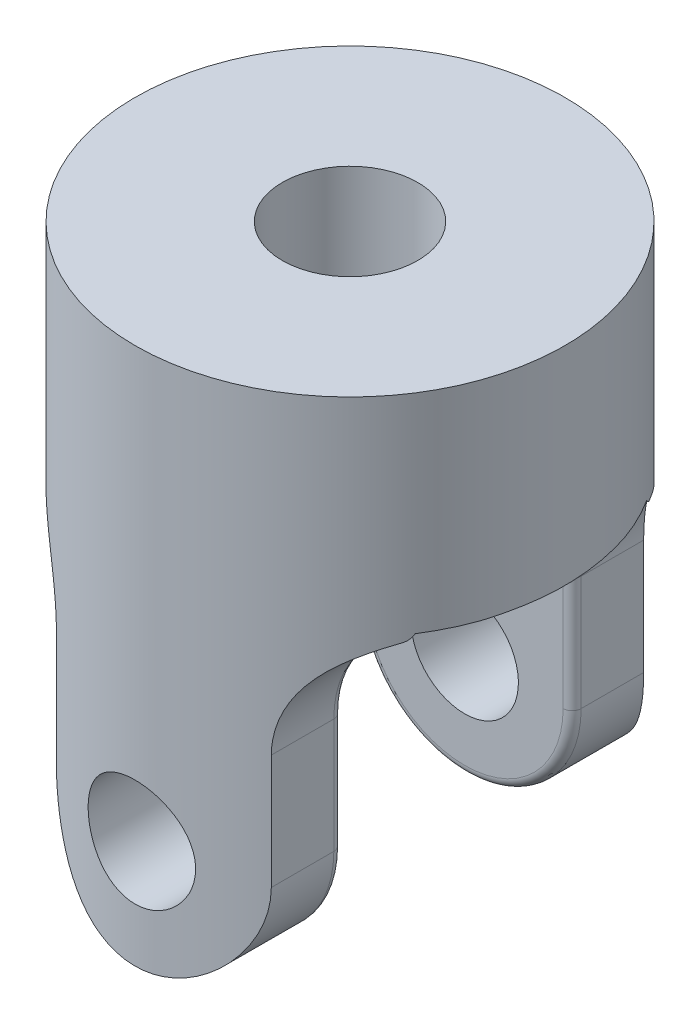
ISO-10303-21;
HEADER;
FILE_DESCRIPTION(('STEP AP214'),'2;1');
FILE_NAME('part.step','',(''),(''),'','','');
FILE_SCHEMA(('AUTOMOTIVE_DESIGN { 1 0 10303 214 1 1 1 1 }'));
ENDSEC;
DATA;
#1=APPLICATION_CONTEXT('core data for automotive mechanical design processes');
#2=APPLICATION_PROTOCOL_DEFINITION('international standard','automotive_design',2000,#1);
#3=PRODUCT_CONTEXT('',#1,'mechanical');
#4=PRODUCT('Part','Part','',(#3));
#5=PRODUCT_RELATED_PRODUCT_CATEGORY('part','',(#4));
#6=PRODUCT_DEFINITION_FORMATION('','',#4);
#7=PRODUCT_DEFINITION_CONTEXT('part definition',#1,'design');
#8=PRODUCT_DEFINITION('design','',#6,#7);
#9=PRODUCT_DEFINITION_SHAPE('','',#8);
#10=(LENGTH_UNIT() NAMED_UNIT(*) SI_UNIT(.MILLI.,.METRE.));
#11=(NAMED_UNIT(*) PLANE_ANGLE_UNIT() SI_UNIT($,.RADIAN.));
#12=(NAMED_UNIT(*) SI_UNIT($,.STERADIAN.) SOLID_ANGLE_UNIT());
#13=UNCERTAINTY_MEASURE_WITH_UNIT(LENGTH_MEASURE(1.E-05),#10,'distance_accuracy_value','');
#14=(GEOMETRIC_REPRESENTATION_CONTEXT(3) GLOBAL_UNCERTAINTY_ASSIGNED_CONTEXT((#13)) GLOBAL_UNIT_ASSIGNED_CONTEXT((#10,
#11,#12)) REPRESENTATION_CONTEXT('',''));
#15=CARTESIAN_POINT('',(0.,0.,0.));
#16=DIRECTION('',(0.,0.,1.));
#17=DIRECTION('',(1.,0.,0.));
#18=AXIS2_PLACEMENT_3D('',#15,#16,#17);
#19=CARTESIAN_POINT('',(0.,47.625,0.));
#20=DIRECTION('',(0.,-1.,0.));
#21=DIRECTION('',(0.,0.,-1.));
#22=AXIS2_PLACEMENT_3D('',#19,#20,#21);
#23=CYLINDRICAL_SURFACE('',#22,19.05);
#24=CARTESIAN_POINT('',(0.,14.2875,-19.05));
#25=CARTESIAN_POINT('',(-0.263131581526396,14.2874926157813,-19.0499955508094));
#26=CARTESIAN_POINT('',(-0.526345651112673,14.2656193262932,-19.0444938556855));
#27=CARTESIAN_POINT('',(-1.04523007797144,14.1788351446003,-19.0230796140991));
#28=CARTESIAN_POINT('',(-1.3008960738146,14.1138998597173,-19.0071611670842));
#29=CARTESIAN_POINT('',(-1.79711626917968,13.9432053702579,-18.966676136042));
#30=CARTESIAN_POINT('',(-2.03768821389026,13.837495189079,-18.9421199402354));
#31=CARTESIAN_POINT('',(-2.49768401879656,13.5884240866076,-18.886974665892));
#32=CARTESIAN_POINT('',(-2.71710716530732,13.4450618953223,-18.8563853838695));
#33=CARTESIAN_POINT('',(-3.13309611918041,13.121637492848,-18.7917903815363));
#34=CARTESIAN_POINT('',(-3.32916431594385,12.940945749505,-18.757731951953));
#35=CARTESIAN_POINT('',(-3.68855284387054,12.5493392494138,-18.6903874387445));
#36=CARTESIAN_POINT('',(-3.85186947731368,12.3384210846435,-18.6571014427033));
#37=CARTESIAN_POINT('',(-4.14345927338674,11.8884851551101,-18.5945391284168));
#38=CARTESIAN_POINT('',(-4.27117578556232,11.6490964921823,-18.5653297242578));
#39=CARTESIAN_POINT('',(-4.48436018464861,11.1513987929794,-18.514996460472));
#40=CARTESIAN_POINT('',(-4.56983482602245,10.8930927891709,-18.4938713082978));
#41=CARTESIAN_POINT('',(-4.69441160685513,10.3703643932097,-18.4626401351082));
#42=CARTESIAN_POINT('',(-4.73440845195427,10.1061682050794,-18.4523218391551));
#43=CARTESIAN_POINT('',(-4.76968113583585,9.57462979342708,-18.443237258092));
#44=CARTESIAN_POINT('',(-4.7649642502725,9.30728808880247,-18.4444690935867));
#45=CARTESIAN_POINT('',(-4.71165721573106,8.78390481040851,-18.4581547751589));
#46=CARTESIAN_POINT('',(-4.66413323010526,8.52774640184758,-18.4703359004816));
#47=CARTESIAN_POINT('',(-4.528261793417,8.02715866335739,-18.5041130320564));
#48=CARTESIAN_POINT('',(-4.43991143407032,7.78273017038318,-18.5257097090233));
#49=CARTESIAN_POINT('',(-4.22398659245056,7.30968179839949,-18.5761348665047));
#50=CARTESIAN_POINT('',(-4.09602516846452,7.08124640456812,-18.6050341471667));
#51=CARTESIAN_POINT('',(-3.80478117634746,6.6487080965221,-18.6667683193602));
#52=CARTESIAN_POINT('',(-3.64149242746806,6.44460944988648,-18.6996038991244));
#53=CARTESIAN_POINT('',(-3.27870637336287,6.06042852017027,-18.7666592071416));
#54=CARTESIAN_POINT('',(-3.07830936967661,5.88119699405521,-18.8008917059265));
#55=CARTESIAN_POINT('',(-2.64989283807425,5.55872255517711,-18.8660394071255));
#56=CARTESIAN_POINT('',(-2.42187246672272,5.41548074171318,-18.8969545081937));
#57=CARTESIAN_POINT('',(-1.94346794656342,5.16873938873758,-18.9521379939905));
#58=CARTESIAN_POINT('',(-1.69300967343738,5.06537804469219,-18.9763831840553));
#59=CARTESIAN_POINT('',(-1.17753132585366,4.90246255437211,-19.0153263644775));
#60=CARTESIAN_POINT('',(-0.912514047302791,4.84290002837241,-19.0300261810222));
#61=CARTESIAN_POINT('',(-0.382714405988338,4.77057222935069,-19.0479521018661));
#62=CARTESIAN_POINT('',(-0.11809958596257,4.75664839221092,-19.0514621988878));
#63=CARTESIAN_POINT('',(0.409679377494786,4.77281558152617,-19.0474220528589));
#64=CARTESIAN_POINT('',(0.67284364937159,4.80290264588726,-19.0398728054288));
#65=CARTESIAN_POINT('',(1.18622530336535,4.90528263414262,-19.0147442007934));
#66=CARTESIAN_POINT('',(1.43657675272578,4.97694351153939,-18.9973151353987));
#67=CARTESIAN_POINT('',(1.92169190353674,5.15971499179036,-18.9543914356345));
#68=CARTESIAN_POINT('',(2.15645402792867,5.27082957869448,-18.928895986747));
#69=CARTESIAN_POINT('',(2.60833595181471,5.5315997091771,-18.8719875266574));
#70=CARTESIAN_POINT('',(2.82506877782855,5.6819041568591,-18.8404775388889));
#71=CARTESIAN_POINT('',(3.23064699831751,6.015957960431,-18.7751881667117));
#72=CARTESIAN_POINT('',(3.41948756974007,6.19971308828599,-18.7414083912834));
#73=CARTESIAN_POINT('',(3.76869505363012,6.60083122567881,-18.6743643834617));
#74=CARTESIAN_POINT('',(3.92824927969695,6.81890845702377,-18.6411331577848));
#75=CARTESIAN_POINT('',(4.20849665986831,7.27942611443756,-18.5798738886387));
#76=CARTESIAN_POINT('',(4.32919153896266,7.5218654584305,-18.5518456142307));
#77=CARTESIAN_POINT('',(4.5273957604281,8.02292566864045,-18.5044745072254));
#78=CARTESIAN_POINT('',(4.60516095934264,8.28144021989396,-18.4850803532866));
#79=CARTESIAN_POINT('',(4.71597247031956,8.80843310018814,-18.457124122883));
#80=CARTESIAN_POINT('',(4.7490285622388,9.0769092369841,-18.4485596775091));
#81=CARTESIAN_POINT('',(4.76897252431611,9.6079342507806,-18.4434131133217));
#82=CARTESIAN_POINT('',(4.75715932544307,9.87043185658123,-18.4464938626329));
#83=CARTESIAN_POINT('',(4.69067285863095,10.3895648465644,-18.4635111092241));
#84=CARTESIAN_POINT('',(4.63600045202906,10.6462003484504,-18.4774473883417));
#85=CARTESIAN_POINT('',(4.48605693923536,11.1449118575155,-18.5144175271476));
#86=CARTESIAN_POINT('',(4.39102945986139,11.3870654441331,-18.5373967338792));
#87=CARTESIAN_POINT('',(4.1632661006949,11.8521650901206,-18.5898712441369));
#88=CARTESIAN_POINT('',(4.03052499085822,12.0751084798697,-18.6193674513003));
#89=CARTESIAN_POINT('',(3.72703010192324,12.5017359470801,-18.6825138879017));
#90=CARTESIAN_POINT('',(3.5553750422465,12.7047659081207,-18.7162524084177));
#91=CARTESIAN_POINT('',(3.18068125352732,13.0795618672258,-18.7835548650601));
#92=CARTESIAN_POINT('',(2.97763508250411,13.2513204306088,-18.8171187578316));
#93=CARTESIAN_POINT('',(2.54148458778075,13.5617309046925,-18.8810155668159));
#94=CARTESIAN_POINT('',(2.30790249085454,13.6997268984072,-18.911278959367));
#95=CARTESIAN_POINT('',(1.82011973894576,13.9342731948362,-18.9644313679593));
#96=CARTESIAN_POINT('',(1.56593401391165,14.0308531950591,-18.9873256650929));
#97=CARTESIAN_POINT('',(1.09350255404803,14.1654905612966,-19.0197758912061));
#98=CARTESIAN_POINT('',(0.877507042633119,14.2111451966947,-19.031032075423));
#99=CARTESIAN_POINT('',(0.441026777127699,14.2721518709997,-19.0461457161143));
#100=CARTESIAN_POINT('',(0.220542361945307,14.2875061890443,-19.0500037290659));
#101=CARTESIAN_POINT('',(0.,14.2875,-19.05));
#102=B_SPLINE_CURVE_WITH_KNOTS('',3,(#24,#25,#26,#27,#28,#29,#30,#31,#32,#33,#34,#35,#36,#37,
#38,#39,#40,#41,#42,#43,#44,#45,#46,#47,#48,#49,#50,#51,#52,#53,#54,#55,#56,#57,#58,#59,#60,#61,
#62,#63,#64,#65,#66,#67,#68,#69,#70,#71,#72,#73,#74,#75,#76,#77,#78,#79,#80,#81,#82,#83,#84,#85,
#86,#87,#88,#89,#90,#91,#92,#93,#94,#95,#96,#97,#98,#99,#100,#101),.UNSPECIFIED.,.T.,.F.,(4,2,2,
2,2,2,2,2,2,2,2,2,2,2,2,2,2,2,2,2,2,2,2,2,2,2,2,2,2,2,2,2,2,2,2,2,2,2,4),(0.,0.788586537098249,
1.57762015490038,2.36570806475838,3.15382256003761,3.95650832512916,4.75928466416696,
5.57398705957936,6.38855914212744,7.18681236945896,7.98493571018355,8.76371428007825,
9.54254833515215,10.3292442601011,11.1160779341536,11.9253476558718,12.7346420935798,
13.5467162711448,14.3586350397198,15.1497763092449,15.940846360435,16.7201937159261,
17.4996197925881,18.2928764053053,19.08627002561,19.8991381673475,20.7119702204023,
21.5199040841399,22.3276611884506,23.1122150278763,23.8967531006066,24.6766207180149,
25.4565965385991,26.2569190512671,27.0574315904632,27.8724418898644,28.6868668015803,
29.3478662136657,30.008815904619),.UNSPECIFIED.);
#103=CARTESIAN_POINT('',(0.,14.2875,-19.05));
#104=VERTEX_POINT('',#103);
#105=EDGE_CURVE('E278',#104,#104,#102,.T.);
#106=ORIENTED_EDGE('',*,*,#105,.T.);
#107=EDGE_LOOP('',(#106));
#108=FACE_BOUND('',#107,.T.);
#109=CARTESIAN_POINT('',(4.7625,9.525,18.4450831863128));
#110=CARTESIAN_POINT('',(4.7624925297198,9.26201331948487,18.4450882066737));
#111=CARTESIAN_POINT('',(4.74064249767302,8.99894396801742,18.4507690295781));
#112=CARTESIAN_POINT('',(4.65395905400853,8.48035976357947,18.4728204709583));
#113=CARTESIAN_POINT('',(4.58910062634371,8.22484939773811,18.4891973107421));
#114=CARTESIAN_POINT('',(4.41863073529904,7.72895925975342,18.5306727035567));
#115=CARTESIAN_POINT('',(4.31307188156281,7.48856041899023,18.5557599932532));
#116=CARTESIAN_POINT('',(4.06435777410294,7.02885782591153,18.6118155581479));
#117=CARTESIAN_POINT('',(3.92120092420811,6.80955496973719,18.6427840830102));
#118=CARTESIAN_POINT('',(3.59798955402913,6.39344356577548,18.7078756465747));
#119=CARTESIAN_POINT('',(3.41725927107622,6.19716769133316,18.7420490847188));
#120=CARTESIAN_POINT('',(3.02548683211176,5.83737454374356,18.8092627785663));
#121=CARTESIAN_POINT('',(2.81444184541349,5.67386033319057,18.8423029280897));
#122=CARTESIAN_POINT('',(2.36438160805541,5.38205273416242,18.9040849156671));
#123=CARTESIAN_POINT('',(2.12501716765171,5.25428263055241,18.9327603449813));
#124=CARTESIAN_POINT('',(1.62737136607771,5.04099262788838,18.98200696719));
#125=CARTESIAN_POINT('',(1.36909280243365,4.95546649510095,19.0025793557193));
#126=CARTESIAN_POINT('',(0.846503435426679,4.8307983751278,19.0329456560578));
#127=CARTESIAN_POINT('',(0.582420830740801,4.79075182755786,19.0429494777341));
#128=CARTESIAN_POINT('',(0.0511089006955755,4.75534028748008,19.0517829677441));
#129=CARTESIAN_POINT('',(-0.216119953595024,4.75996868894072,19.0506142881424));
#130=CARTESIAN_POINT('',(-0.739865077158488,4.81312508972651,19.0373907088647));
#131=CARTESIAN_POINT('',(-0.996487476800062,4.86067669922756,19.0255779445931));
#132=CARTESIAN_POINT('',(-1.4979884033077,4.99676026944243,18.992675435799));
#133=CARTESIAN_POINT('',(-1.74286630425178,5.08529441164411,18.9715851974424));
#134=CARTESIAN_POINT('',(-2.21649942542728,5.30161989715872,18.9221270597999));
#135=CARTESIAN_POINT('',(-2.44508897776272,5.42975872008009,18.8936951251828));
#136=CARTESIAN_POINT('',(-2.87786265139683,5.72139256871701,18.8326376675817));
#137=CARTESIAN_POINT('',(-3.08204251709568,5.88489374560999,18.8000114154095));
#138=CARTESIAN_POINT('',(-3.46602384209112,6.24784515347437,18.733078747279));
#139=CARTESIAN_POINT('',(-3.6450159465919,6.44814856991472,18.6987507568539));
#140=CARTESIAN_POINT('',(-3.96704999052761,6.87628794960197,18.6330915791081));
#141=CARTESIAN_POINT('',(-4.11009024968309,7.10412519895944,18.6017605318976));
#142=CARTESIAN_POINT('',(-4.35667846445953,7.58245251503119,18.5455654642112));
#143=CARTESIAN_POINT('',(-4.46003156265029,7.8330470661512,18.5207335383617));
#144=CARTESIAN_POINT('',(-4.6228902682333,8.34882531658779,18.4807600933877));
#145=CARTESIAN_POINT('',(-4.68240525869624,8.61400588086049,18.4656165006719));
#146=CARTESIAN_POINT('',(-4.75455546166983,9.14392285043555,18.4471695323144));
#147=CARTESIAN_POINT('',(-4.76838735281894,9.40848599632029,18.4435639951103));
#148=CARTESIAN_POINT('',(-4.75205486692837,9.93614078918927,18.4477788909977));
#149=CARTESIAN_POINT('',(-4.72189453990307,10.1992325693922,18.4555982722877));
#150=CARTESIAN_POINT('',(-4.61948300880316,10.7120326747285,18.4814924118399));
#151=CARTESIAN_POINT('',(-4.54792855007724,10.9618895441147,18.4993972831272));
#152=CARTESIAN_POINT('',(-4.36553244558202,11.4460619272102,18.5432836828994));
#153=CARTESIAN_POINT('',(-4.25468614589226,11.6803755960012,18.5692661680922));
#154=CARTESIAN_POINT('',(-3.99434812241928,12.1318806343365,18.6270164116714));
#155=CARTESIAN_POINT('',(-3.84414094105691,12.3486459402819,18.6588876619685));
#156=CARTESIAN_POINT('',(-3.51024964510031,12.7543338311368,18.7245704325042));
#157=CARTESIAN_POINT('',(-3.3265600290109,12.9432518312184,18.7583822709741));
#158=CARTESIAN_POINT('',(-2.92542620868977,13.2927300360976,18.8251605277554));
#159=CARTESIAN_POINT('',(-2.70725242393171,13.4524624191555,18.8580846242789));
#160=CARTESIAN_POINT('',(-2.24648402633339,13.7330228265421,18.9185019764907));
#161=CARTESIAN_POINT('',(-2.00389068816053,13.8538528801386,18.9459955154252));
#162=CARTESIAN_POINT('',(-1.50284593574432,14.0521296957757,18.9922807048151));
#163=CARTESIAN_POINT('',(-1.24452402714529,14.1298884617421,19.0111347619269));
#164=CARTESIAN_POINT('',(-0.717945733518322,14.240751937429,19.0382898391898));
#165=CARTESIAN_POINT('',(-0.449691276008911,14.2738652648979,19.0465928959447));
#166=CARTESIAN_POINT('',(0.0813602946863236,14.2940131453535,19.0516273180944));
#167=CARTESIAN_POINT('',(0.344108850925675,14.2822693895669,19.0486654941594));
#168=CARTESIAN_POINT('',(0.863762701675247,14.2158347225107,19.0321833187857));
#169=CARTESIAN_POINT('',(1.12066816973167,14.1611450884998,19.0186632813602));
#170=CARTESIAN_POINT('',(1.62006455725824,14.0110263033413,18.9826312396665));
#171=CARTESIAN_POINT('',(1.86262563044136,13.9158180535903,18.9601680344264));
#172=CARTESIAN_POINT('',(2.32846746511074,13.6875651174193,18.908615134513));
#173=CARTESIAN_POINT('',(2.55174579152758,13.5545156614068,18.8795246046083));
#174=CARTESIAN_POINT('',(2.97847668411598,13.2506311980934,18.8169827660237));
#175=CARTESIAN_POINT('',(3.18132613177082,13.0789673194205,18.7834436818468));
#176=CARTESIAN_POINT('',(3.55575403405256,12.7043361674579,18.7161796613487));
#177=CARTESIAN_POINT('',(3.72732454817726,12.5013609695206,18.6824546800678));
#178=CARTESIAN_POINT('',(4.0374666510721,12.0653107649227,18.6179210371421));
#179=CARTESIAN_POINT('',(4.1753628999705,11.831744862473,18.5871785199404));
#180=CARTESIAN_POINT('',(4.4097268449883,11.3440107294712,18.5329808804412));
#181=CARTESIAN_POINT('',(4.50622468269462,11.0898576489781,18.5095204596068));
#182=CARTESIAN_POINT('',(4.6406872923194,10.617626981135,18.4762096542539));
#183=CARTESIAN_POINT('',(4.68626747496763,10.401808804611,18.4646250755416));
#184=CARTESIAN_POINT('',(4.74717566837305,9.96567951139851,18.4490600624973));
#185=CARTESIAN_POINT('',(4.76250625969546,9.74536877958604,18.4450789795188));
#186=CARTESIAN_POINT('',(4.7625,9.525,18.4450831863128));
#187=B_SPLINE_CURVE_WITH_KNOTS('',3,(#109,#110,#111,#112,#113,#114,#115,#116,#117,#118,#119,
#120,#121,#122,#123,#124,#125,#126,#127,#128,#129,#130,#131,#132,#133,#134,#135,#136,#137,#138,
#139,#140,#141,#142,#143,#144,#145,#146,#147,#148,#149,#150,#151,#152,#153,#154,#155,#156,#157,
#158,#159,#160,#161,#162,#163,#164,#165,#166,#167,#168,#169,#170,#171,#172,#173,#174,#175,#176,
#177,#178,#179,#180,#181,#182,#183,#184,#185,#186),.UNSPECIFIED.,.T.,.F.,(4,2,2,2,2,2,2,2,2,2,2,
2,2,2,2,2,2,2,2,2,2,2,2,2,2,2,2,2,2,2,2,2,2,2,2,2,2,2,4),(0.,0.788150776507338,1.57676038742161,
2.36435403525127,3.15198112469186,3.95523632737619,4.75856658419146,5.57310600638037,
6.3875251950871,7.18544570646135,7.98324823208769,8.76334790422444,9.54348910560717,
10.3306792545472,11.1180064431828,11.9266423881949,12.7353161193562,13.5479110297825,
14.3603319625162,15.1512950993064,15.9421854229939,16.7201355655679,17.4981778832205,
18.2914832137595,19.0849190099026,19.8982075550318,20.7114536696,21.5187289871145,
22.3258484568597,23.1111446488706,23.896417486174,24.677462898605,25.4586067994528,
26.258464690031,27.0585253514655,27.8735118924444,28.6879040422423,29.3483886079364,
30.0088168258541),.UNSPECIFIED.);
#188=CARTESIAN_POINT('',(4.7625,9.525,18.4450831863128));
#189=VERTEX_POINT('',#188);
#190=EDGE_CURVE('E286',#189,#189,#187,.T.);
#191=ORIENTED_EDGE('',*,*,#190,.T.);
#192=EDGE_LOOP('',(#191));
#193=FACE_BOUND('',#192,.T.);
#194=CARTESIAN_POINT('',(0.,47.625,0.));
#195=DIRECTION('',(0.,1.,0.));
#196=DIRECTION('',(0.,0.,1.));
#197=AXIS2_PLACEMENT_3D('',#194,#195,#196);
#198=CIRCLE('',#197,19.05);
#199=CARTESIAN_POINT('',(0.,47.625,19.05));
#200=VERTEX_POINT('',#199);
#201=EDGE_CURVE('E204',#200,#200,#198,.T.);
#202=ORIENTED_EDGE('',*,*,#201,.F.);
#203=EDGE_LOOP('',(#202));
#204=FACE_BOUND('',#203,.T.);
#205=CARTESIAN_POINT('',(0.,29.1452388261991,0.));
#206=DIRECTION('',(0.,1.,0.));
#207=DIRECTION('',(0.,0.,1.));
#208=AXIS2_PLACEMENT_3D('',#205,#206,#207);
#209=CIRCLE('',#208,19.05);
#210=CARTESIAN_POINT('',(-17.9411689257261,29.1452388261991,6.40444826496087));
#211=VERTEX_POINT('',#210);
#212=CARTESIAN_POINT('',(-16.0465941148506,29.1452388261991,10.2669039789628));
#213=VERTEX_POINT('',#212);
#214=EDGE_CURVE('E189',#211,#213,#209,.T.);
#215=ORIENTED_EDGE('',*,*,#214,.T.);
#216=CARTESIAN_POINT('',(-16.0465941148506,29.1452388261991,10.2669039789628));
#217=CARTESIAN_POINT('',(-16.03727687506,29.1157831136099,10.2814663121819));
#218=CARTESIAN_POINT('',(-16.0271745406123,29.0872011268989,10.2972119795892));
#219=CARTESIAN_POINT('',(-16.0055557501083,29.0318945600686,10.3307833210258));
#220=CARTESIAN_POINT('',(-15.9940408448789,29.0051679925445,10.3486067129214));
#221=CARTESIAN_POINT('',(-15.9576708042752,28.9280401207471,10.4046726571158));
#222=CARTESIAN_POINT('',(-15.9309167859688,28.8804640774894,10.4456265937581));
#223=CARTESIAN_POINT('',(-15.8742304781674,28.7948098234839,10.5315660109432));
#224=CARTESIAN_POINT('',(-15.8444182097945,28.7564886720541,10.5763928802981));
#225=CARTESIAN_POINT('',(-15.7816164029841,28.6878878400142,10.6698758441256));
#226=CARTESIAN_POINT('',(-15.7486256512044,28.6576112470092,10.7185333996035));
#227=CARTESIAN_POINT('',(-15.6930675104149,28.6155571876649,10.7996090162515));
#228=CARTESIAN_POINT('',(-15.67127965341,28.6011148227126,10.8312051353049));
#229=CARTESIAN_POINT('',(-15.6268999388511,28.575819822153,10.8951372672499));
#230=CARTESIAN_POINT('',(-15.6043100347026,28.5649590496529,10.9274714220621));
#231=CARTESIAN_POINT('',(-15.5813577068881,28.5559720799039,10.9601));
#232=B_SPLINE_CURVE_WITH_KNOTS('',3,(#216,#217,#218,#219,#220,#221,#222,#223,#224,#225,#226,
#227,#228,#229,#230,#231),.UNSPECIFIED.,.F.,.F.,(4,2,2,2,2,2,2,4),(0.,0.102363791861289,
0.204616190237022,0.408337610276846,0.605922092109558,0.803582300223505,0.926449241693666,
1.04903509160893),.UNSPECIFIED.);
#233=CARTESIAN_POINT('',(-15.5813577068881,28.5559720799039,10.9601));
#234=VERTEX_POINT('',#233);
#235=EDGE_CURVE('E369',#213,#234,#232,.T.);
#236=ORIENTED_EDGE('',*,*,#235,.T.);
#237=CARTESIAN_POINT('',(-9.525,19.685,-16.4977839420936));
#238=CARTESIAN_POINT('',(-9.52496088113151,19.918350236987,-16.4977688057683));
#239=CARTESIAN_POINT('',(-9.53357353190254,20.1516967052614,-16.4928328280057));
#240=CARTESIAN_POINT('',(-9.56782146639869,20.6166980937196,-16.4730087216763));
#241=CARTESIAN_POINT('',(-9.59345572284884,20.8483531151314,-16.4581211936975));
#242=CARTESIAN_POINT('',(-9.66141942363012,21.3080009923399,-16.4183108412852));
#243=CARTESIAN_POINT('',(-9.70372594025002,21.5359984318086,-16.3934017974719));
#244=CARTESIAN_POINT('',(-9.80447669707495,21.9870210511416,-16.3333461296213));
#245=CARTESIAN_POINT('',(-9.86292069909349,22.2100463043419,-16.2981996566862));
#246=CARTESIAN_POINT('',(-9.99521577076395,22.6496636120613,-16.217402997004));
#247=CARTESIAN_POINT('',(-10.0690752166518,22.8662520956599,-16.1717470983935));
#248=CARTESIAN_POINT('',(-10.2311827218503,23.2913603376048,-16.0696785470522));
#249=CARTESIAN_POINT('',(-10.3194309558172,23.4998799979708,-16.0132657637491));
#250=CARTESIAN_POINT('',(-10.5090589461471,23.9073731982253,-15.8894615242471));
#251=CARTESIAN_POINT('',(-10.6104339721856,24.1063501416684,-15.8220740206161));
#252=CARTESIAN_POINT('',(-10.8249101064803,24.4935871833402,-15.676116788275));
#253=CARTESIAN_POINT('',(-10.9380111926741,24.6818473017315,-15.597547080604));
#254=CARTESIAN_POINT('',(-11.1750060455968,25.0476354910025,-15.4286429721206));
#255=CARTESIAN_POINT('',(-11.2989577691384,25.2250961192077,-15.3382439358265));
#256=CARTESIAN_POINT('',(-11.5553164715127,25.5672655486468,-15.1460495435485));
#257=CARTESIAN_POINT('',(-11.6877234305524,25.7319743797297,-15.0442542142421));
#258=CARTESIAN_POINT('',(-11.9591574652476,26.0480960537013,-14.8293967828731));
#259=CARTESIAN_POINT('',(-12.0981857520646,26.1995064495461,-14.7163326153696));
#260=CARTESIAN_POINT('',(-12.3809708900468,26.4887188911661,-14.4792302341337));
#261=CARTESIAN_POINT('',(-12.5247282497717,26.6265194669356,-14.3551908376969));
#262=CARTESIAN_POINT('',(-12.8240785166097,26.8965620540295,-14.0885806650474));
#263=CARTESIAN_POINT('',(-12.9798547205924,27.0279377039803,-13.9453388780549));
#264=CARTESIAN_POINT('',(-13.292575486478,27.2756182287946,-13.6475843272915));
#265=CARTESIAN_POINT('',(-13.4495200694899,27.3919228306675,-13.4930713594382));
#266=CARTESIAN_POINT('',(-13.7627279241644,27.6100750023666,-13.1734537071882));
#267=CARTESIAN_POINT('',(-13.91899104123,27.7119194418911,-13.0083467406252));
#268=CARTESIAN_POINT('',(-14.2291584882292,27.9019462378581,-12.6683290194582));
#269=CARTESIAN_POINT('',(-14.3830623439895,27.9901258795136,-12.4934163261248));
#270=CARTESIAN_POINT('',(-14.7634251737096,28.1948863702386,-12.0444336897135));
#271=CARTESIAN_POINT('',(-14.9875078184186,28.3034922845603,-11.7646791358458));
#272=CARTESIAN_POINT('',(-15.4232003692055,28.4957157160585,-11.1874194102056));
#273=CARTESIAN_POINT('',(-15.6348051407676,28.5793230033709,-10.8899070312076));
#274=CARTESIAN_POINT('',(-16.0431146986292,28.7255421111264,-10.2789237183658));
#275=CARTESIAN_POINT('',(-16.2397846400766,28.7881059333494,-9.96541815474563));
#276=CARTESIAN_POINT('',(-16.615638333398,28.8957388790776,-9.3252837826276));
#277=CARTESIAN_POINT('',(-16.7948218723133,28.9408077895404,-8.99865481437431));
#278=CARTESIAN_POINT('',(-17.1918461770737,29.029905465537,-8.22145899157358));
#279=CARTESIAN_POINT('',(-17.4021973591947,29.0684013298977,-7.76641658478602));
#280=CARTESIAN_POINT('',(-17.786699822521,29.1278564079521,-6.84014068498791));
#281=CARTESIAN_POINT('',(-17.9608394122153,29.1488099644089,-6.36890201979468));
#282=CARTESIAN_POINT('',(-18.2714417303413,29.1794105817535,-5.41378881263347));
#283=CARTESIAN_POINT('',(-18.4079009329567,29.1890565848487,-4.92991309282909));
#284=CARTESIAN_POINT('',(-18.6421466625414,29.2019870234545,-3.95287775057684));
#285=CARTESIAN_POINT('',(-18.7399368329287,29.2052720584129,-3.45971900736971));
#286=CARTESIAN_POINT('',(-18.897358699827,29.2091078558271,-2.4600813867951));
#287=CARTESIAN_POINT('',(-18.9564226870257,29.2096187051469,-1.95351291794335));
#288=CARTESIAN_POINT('',(-19.033752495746,29.2100647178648,-0.937263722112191));
#289=CARTESIAN_POINT('',(-19.0520174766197,29.209999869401,-0.427582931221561));
#290=CARTESIAN_POINT('',(-19.0476285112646,29.2100001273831,0.591825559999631));
#291=CARTESIAN_POINT('',(-19.0249568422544,29.2100652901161,1.10155318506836));
#292=CARTESIAN_POINT('',(-18.9388075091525,29.2094475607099,2.11754548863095));
#293=CARTESIAN_POINT('',(-18.8753295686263,29.2087646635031,2.62381014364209));
#294=CARTESIAN_POINT('',(-18.7036160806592,29.2041086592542,3.65580332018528));
#295=CARTESIAN_POINT('',(-18.5932233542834,29.1999661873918,4.18117378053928));
#296=CARTESIAN_POINT('',(-18.3285057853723,29.1835599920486,5.2207365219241));
#297=CARTESIAN_POINT('',(-18.1741722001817,29.1712946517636,5.73492655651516));
#298=CARTESIAN_POINT('',(-17.8230306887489,29.1322930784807,6.74751648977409));
#299=CARTESIAN_POINT('',(-17.6262637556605,29.1055707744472,7.24593109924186));
#300=CARTESIAN_POINT('',(-17.1921907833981,29.0296619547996,8.22291578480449));
#301=CARTESIAN_POINT('',(-16.9549063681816,28.9804873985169,8.7014962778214));
#302=CARTESIAN_POINT('',(-16.5317482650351,28.8726944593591,9.47232063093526));
#303=CARTESIAN_POINT('',(-16.356505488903,28.8232353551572,9.77172744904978));
#304=CARTESIAN_POINT('',(-15.9915321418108,28.7076409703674,10.3582119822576));
#305=CARTESIAN_POINT('',(-15.8018055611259,28.6415102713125,10.6452930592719));
#306=CARTESIAN_POINT('',(-15.4100602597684,28.4895738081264,11.2048655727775));
#307=CARTESIAN_POINT('',(-15.2080616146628,28.4037995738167,11.4773795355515));
#308=CARTESIAN_POINT('',(-14.794100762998,28.2093882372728,12.0062371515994));
#309=CARTESIAN_POINT('',(-14.5821407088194,28.1007560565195,12.2625842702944));
#310=CARTESIAN_POINT('',(-14.1961331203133,27.8828084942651,12.7059055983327));
#311=CARTESIAN_POINT('',(-14.0232896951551,27.7782615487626,12.8962780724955));
#312=CARTESIAN_POINT('',(-13.6756323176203,27.5516907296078,13.2643740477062));
#313=CARTESIAN_POINT('',(-13.5008188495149,27.4296710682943,13.4421005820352));
#314=CARTESIAN_POINT('',(-13.1516762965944,27.1671845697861,13.7838888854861));
#315=CARTESIAN_POINT('',(-12.9773471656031,27.0267195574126,13.947952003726));
#316=CARTESIAN_POINT('',(-12.6319391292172,26.726763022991,14.2615225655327));
#317=CARTESIAN_POINT('',(-12.4608602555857,26.5672713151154,14.4110298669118));
#318=CARTESIAN_POINT('',(-12.1237135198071,26.2279198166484,14.6958204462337));
#319=CARTESIAN_POINT('',(-11.9576926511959,26.0479167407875,14.8309890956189));
#320=CARTESIAN_POINT('',(-11.6351953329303,25.6689938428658,15.0853214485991));
#321=CARTESIAN_POINT('',(-11.4787191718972,25.4700734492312,15.2044846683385));
#322=CARTESIAN_POINT('',(-11.1784747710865,25.0543983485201,15.4265708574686));
#323=CARTESIAN_POINT('',(-11.0347050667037,24.8376457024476,15.5294956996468));
#324=CARTESIAN_POINT('',(-10.7628059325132,24.3878782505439,15.7191604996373));
#325=CARTESIAN_POINT('',(-10.6346741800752,24.154865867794,15.8059028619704));
#326=CARTESIAN_POINT('',(-10.4115375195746,23.7046522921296,15.9536199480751));
#327=CARTESIAN_POINT('',(-10.3143937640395,23.4891174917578,16.0164604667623));
#328=CARTESIAN_POINT('',(-10.1355425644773,23.04871010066,16.1302361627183));
#329=CARTESIAN_POINT('',(-10.0538339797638,22.8238382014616,16.181172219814));
#330=CARTESIAN_POINT('',(-9.90713729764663,22.3666546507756,16.2714028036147));
#331=CARTESIAN_POINT('',(-9.84213485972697,22.1343495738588,16.3107073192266));
#332=CARTESIAN_POINT('',(-9.72972257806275,21.6640173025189,16.3780123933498));
#333=CARTESIAN_POINT('',(-9.6823065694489,21.4259921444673,16.4060169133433));
#334=CARTESIAN_POINT('',(-9.60449707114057,20.9383691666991,16.4516946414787));
#335=CARTESIAN_POINT('',(-9.57468865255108,20.6886433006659,16.4690135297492));
#336=CARTESIAN_POINT('',(-9.54488066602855,20.3127872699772,16.48629321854));
#337=CARTESIAN_POINT('',(-9.5374287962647,20.1873921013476,16.4906033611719));
#338=CARTESIAN_POINT('',(-9.52748802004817,19.9363374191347,16.4963477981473));
#339=CARTESIAN_POINT('',(-9.52499919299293,19.8106779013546,16.4977820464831));
#340=CARTESIAN_POINT('',(-9.525,19.685,16.4977839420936));
#341=B_SPLINE_CURVE_WITH_KNOTS('',3,(#237,#238,#239,#240,#241,#242,#243,#244,#245,#246,#247,
#248,#249,#250,#251,#252,#253,#254,#255,#256,#257,#258,#259,#260,#261,#262,#263,#264,#265,#266,
#267,#268,#269,#270,#271,#272,#273,#274,#275,#276,#277,#278,#279,#280,#281,#282,#283,#284,#285,
#286,#287,#288,#289,#290,#291,#292,#293,#294,#295,#296,#297,#298,#299,#300,#301,#302,#303,#304,
#305,#306,#307,#308,#309,#310,#311,#312,#313,#314,#315,#316,#317,#318,#319,#320,#321,#322,#323,
#324,#325,#326,#327,#328,#329,#330,#331,#332,#333,#334,#335,#336,#337,#338,#339,#340),
.UNSPECIFIED.,.F.,.F.,(4,2,2,2,2,2,2,2,2,2,2,2,2,2,2,2,2,2,2,2,2,2,2,2,2,2,2,2,2,2,2,2,2,2,2,2,
2,2,2,2,2,2,2,2,2,2,2,2,2,2,2,4),(0.,0.699834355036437,1.39962647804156,2.09845958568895,
2.79728237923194,3.49648588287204,4.19569787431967,4.8946585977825,5.59361800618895,
6.29656980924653,6.99951996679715,7.70259920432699,8.40575429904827,9.15225685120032,
9.89877292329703,10.6454503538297,11.3922759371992,12.514141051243,13.6364646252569,
14.7613310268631,15.8862111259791,17.392458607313,18.899191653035,20.40606563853,
21.9127976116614,23.4411511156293,24.9695361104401,26.4985829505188,28.0276401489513,
29.6362655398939,31.2452112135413,32.852609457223,34.4591525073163,35.50965675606,
36.5598726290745,37.6084144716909,38.6567307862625,39.4886840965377,40.3204371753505,
41.1521080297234,41.9837870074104,42.8216802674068,43.6595988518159,44.4974207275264,
45.3351180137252,46.0680642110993,46.8009562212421,47.5332170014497,48.2652208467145,
49.02034913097,49.3973072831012,49.7742714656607),.UNSPECIFIED.);
#342=CARTESIAN_POINT('',(-9.525,19.685,16.4977839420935));
#343=VERTEX_POINT('',#342);
#344=EDGE_CURVE('E503',#234,#343,#341,.T.);
#345=ORIENTED_EDGE('',*,*,#344,.T.);
#346=DIRECTION('',(0.,-1.,0.));
#347=VECTOR('',#346,1.);
#348=CARTESIAN_POINT('',(-9.52499999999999,47.625,16.4977839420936));
#349=LINE('',#348,#347);
#350=CARTESIAN_POINT('',(-9.525,9.525,16.4977839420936));
#351=VERTEX_POINT('',#350);
#352=EDGE_CURVE('E504',#343,#351,#349,.T.);
#353=ORIENTED_EDGE('',*,*,#352,.T.);
#354=CARTESIAN_POINT('',(9.525,9.525,16.4977839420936));
#355=CARTESIAN_POINT('',(9.52500093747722,9.40027257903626,16.4977810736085));
#356=CARTESIAN_POINT('',(9.5225495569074,9.27556275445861,16.4991989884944));
#357=CARTESIAN_POINT('',(9.51275833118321,9.02640408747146,16.504847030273));
#358=CARTESIAN_POINT('',(9.50541869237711,8.90195523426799,16.5090770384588));
#359=CARTESIAN_POINT('',(9.47610793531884,8.52953393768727,16.5259318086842));
#360=CARTESIAN_POINT('',(9.4468449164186,8.28227418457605,16.5427214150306));
#361=CARTESIAN_POINT('',(9.36949132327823,7.79316834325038,16.5866536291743));
#362=CARTESIAN_POINT('',(9.32150961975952,7.55129934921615,16.6137363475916));
#363=CARTESIAN_POINT('',(9.20730560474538,7.07314911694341,16.6772985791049));
#364=CARTESIAN_POINT('',(9.14108119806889,6.83686852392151,16.7137791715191));
#365=CARTESIAN_POINT('',(8.99129510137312,6.37194751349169,16.7948306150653));
#366=CARTESIAN_POINT('',(8.90777526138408,6.14329017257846,16.8393819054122));
#367=CARTESIAN_POINT('',(8.72407711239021,5.69420111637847,16.9352799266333));
#368=CARTESIAN_POINT('',(8.62389244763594,5.47377257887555,16.9866292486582));
#369=CARTESIAN_POINT('',(8.29930376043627,4.82601405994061,17.1488381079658));
#370=CARTESIAN_POINT('',(8.05095104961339,4.41247529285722,17.2678097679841));
#371=CARTESIAN_POINT('',(7.47383610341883,3.59736922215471,17.5257462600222));
#372=CARTESIAN_POINT('',(7.14015861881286,3.19954734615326,17.6655504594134));
#373=CARTESIAN_POINT('',(6.5945742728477,2.64718480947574,17.8732248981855));
#374=CARTESIAN_POINT('',(6.40509661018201,2.47038257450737,17.9421446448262));
#375=CARTESIAN_POINT('',(6.01181385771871,2.13237428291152,18.0777156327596));
#376=CARTESIAN_POINT('',(5.80800671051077,1.97117047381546,18.1443665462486));
#377=CARTESIAN_POINT('',(5.3727806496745,1.65505544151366,18.2781569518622));
#378=CARTESIAN_POINT('',(5.14042653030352,1.50131409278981,18.3450225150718));
#379=CARTESIAN_POINT('',(4.66194023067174,1.21417930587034,18.4724136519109));
#380=CARTESIAN_POINT('',(4.41581396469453,1.08077722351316,18.5329419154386));
#381=CARTESIAN_POINT('',(3.91130485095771,0.835583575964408,18.6459377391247));
#382=CARTESIAN_POINT('',(3.65292491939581,0.723786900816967,18.6984072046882));
#383=CARTESIAN_POINT('',(3.1257193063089,0.523053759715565,18.7937250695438));
#384=CARTESIAN_POINT('',(2.85689473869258,0.434114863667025,18.8365744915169));
#385=CARTESIAN_POINT('',(2.33040396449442,0.2857231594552,18.9086545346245));
#386=CARTESIAN_POINT('',(2.07330466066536,0.224622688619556,18.9386372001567));
#387=CARTESIAN_POINT('',(1.55394863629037,0.123892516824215,18.9883061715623));
#388=CARTESIAN_POINT('',(1.29169214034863,0.0842618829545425,19.0079929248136));
#389=CARTESIAN_POINT('',(0.76432935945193,0.0270138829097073,19.0364912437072));
#390=CARTESIAN_POINT('',(0.499224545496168,0.00938565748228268,19.0453081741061));
#391=CARTESIAN_POINT('',(-0.0316607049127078,-0.00364684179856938,19.0518227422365));
#392=CARTESIAN_POINT('',(-0.297441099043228,0.000947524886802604,19.0495210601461));
#393=CARTESIAN_POINT('',(-0.804260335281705,0.0309220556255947,19.0345541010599));
#394=CARTESIAN_POINT('',(-1.04543822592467,0.0544573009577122,19.0228087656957));
#395=CARTESIAN_POINT('',(-1.52469707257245,0.119714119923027,18.9904047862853));
#396=CARTESIAN_POINT('',(-1.76277824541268,0.161434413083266,18.9697467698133));
#397=CARTESIAN_POINT('',(-2.23423979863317,0.262606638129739,18.9200123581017));
#398=CARTESIAN_POINT('',(-2.46762011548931,0.322058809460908,18.8909358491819));
#399=CARTESIAN_POINT('',(-2.92820911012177,0.458088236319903,18.8250425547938));
#400=CARTESIAN_POINT('',(-3.15541756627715,0.534666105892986,18.7882254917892));
#401=CARTESIAN_POINT('',(-3.60539303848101,0.705394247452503,18.7071268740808));
#402=CARTESIAN_POINT('',(-3.82805781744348,0.799769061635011,18.662750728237));
#403=CARTESIAN_POINT('',(-4.26455258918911,1.00458926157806,18.5678772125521));
#404=CARTESIAN_POINT('',(-4.47837941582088,1.11504034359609,18.51737767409));
#405=CARTESIAN_POINT('',(-5.10493628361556,1.46924131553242,18.3583058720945));
#406=CARTESIAN_POINT('',(-5.50300713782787,1.73594015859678,18.2421108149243));
#407=CARTESIAN_POINT('',(-6.28824042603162,2.35173975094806,17.9874060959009));
#408=CARTESIAN_POINT('',(-6.67082158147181,2.70624414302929,17.8478253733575));
#409=CARTESIAN_POINT('',(-7.19758780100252,3.28095380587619,17.638966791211));
#410=CARTESIAN_POINT('',(-7.36544169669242,3.47985996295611,17.5693768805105));
#411=CARTESIAN_POINT('',(-7.68466910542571,3.89124176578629,17.4321111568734));
#412=CARTESIAN_POINT('',(-7.83604008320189,4.10371949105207,17.3644356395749));
#413=CARTESIAN_POINT('',(-8.13051871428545,4.55533319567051,17.2286143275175));
#414=CARTESIAN_POINT('',(-8.27246277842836,4.79530464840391,17.1607200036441));
#415=CARTESIAN_POINT('',(-8.53533313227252,5.28806294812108,17.0315012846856));
#416=CARTESIAN_POINT('',(-8.65626905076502,5.5408438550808,16.9701738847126));
#417=CARTESIAN_POINT('',(-8.87577538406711,6.05731622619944,16.856404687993));
#418=CARTESIAN_POINT('',(-8.97438588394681,6.32098711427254,16.8039470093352));
#419=CARTESIAN_POINT('',(-9.14827185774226,6.85774586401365,16.7099199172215));
#420=CARTESIAN_POINT('',(-9.22355744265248,7.13082958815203,16.6683457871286));
#421=CARTESIAN_POINT('',(-9.32597272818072,7.57995506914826,16.6111629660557));
#422=CARTESIAN_POINT('',(-9.36056268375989,7.75384156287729,16.5916705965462));
#423=CARTESIAN_POINT('',(-9.42003837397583,8.10374181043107,16.5579753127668));
#424=CARTESIAN_POINT('',(-9.44492679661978,8.27975496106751,16.5437709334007));
#425=CARTESIAN_POINT('',(-9.4848665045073,8.63355937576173,16.5209069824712));
#426=CARTESIAN_POINT('',(-9.49990078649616,8.81135317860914,16.5122569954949));
#427=CARTESIAN_POINT('',(-9.51997579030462,9.16776164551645,16.5006843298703));
#428=CARTESIAN_POINT('',(-9.52501242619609,9.34637661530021,16.4977639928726));
#429=CARTESIAN_POINT('',(-9.525,9.525,16.4977839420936));
#430=B_SPLINE_CURVE_WITH_KNOTS('',3,(#354,#355,#356,#357,#358,#359,#360,#361,#362,#363,#364,
#365,#366,#367,#368,#369,#370,#371,#372,#373,#374,#375,#376,#377,#378,#379,#380,#381,#382,#383,
#384,#385,#386,#387,#388,#389,#390,#391,#392,#393,#394,#395,#396,#397,#398,#399,#400,#401,#402,
#403,#404,#405,#406,#407,#408,#409,#410,#411,#412,#413,#414,#415,#416,#417,#418,#419,#420,#421,
#422,#423,#424,#425,#426,#427,#428,#429),.UNSPECIFIED.,.F.,.F.,(4,2,2,2,2,2,2,2,2,2,2,2,2,2,2,2,
2,2,2,2,2,2,2,2,2,2,2,2,2,2,2,2,2,2,2,2,2,4),(0.,0.374115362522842,0.748214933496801,
1.49577871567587,2.23905786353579,2.98242241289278,3.72400882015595,4.4658787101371,
5.95045512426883,7.55645263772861,8.36024673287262,9.16415647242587,10.0226343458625,
10.8807463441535,11.7386551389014,12.5964726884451,13.3932583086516,14.1900093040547,
14.9863669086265,15.7826757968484,16.5096401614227,17.2365533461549,17.9634763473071,
18.6904254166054,19.4272479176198,20.1643321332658,21.6376476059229,23.250115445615,
24.0576502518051,24.8653090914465,25.725087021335,26.5844698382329,27.4422971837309,
28.2997521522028,28.8345228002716,29.3691451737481,29.9046876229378,30.4404488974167),.UNSPECIFIED.);
#431=CARTESIAN_POINT('',(9.525,9.525,16.4977839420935));
#432=VERTEX_POINT('',#431);
#433=EDGE_CURVE('E246',#432,#351,#430,.T.);
#434=ORIENTED_EDGE('',*,*,#433,.F.);
#435=DIRECTION('',(0.,-1.,0.));
#436=VECTOR('',#435,1.);
#437=CARTESIAN_POINT('',(9.52499999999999,47.625,16.4977839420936));
#438=LINE('',#437,#436);
#439=CARTESIAN_POINT('',(9.525,19.685,16.4977839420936));
#440=VERTEX_POINT('',#439);
#441=EDGE_CURVE('E202',#440,#432,#438,.T.);
#442=ORIENTED_EDGE('',*,*,#441,.F.);
#443=CARTESIAN_POINT('',(9.525,19.685,-16.4977839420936));
#444=CARTESIAN_POINT('',(9.52496088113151,19.918350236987,-16.4977688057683));
#445=CARTESIAN_POINT('',(9.53357353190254,20.1516967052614,-16.4928328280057));
#446=CARTESIAN_POINT('',(9.56782146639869,20.6166980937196,-16.4730087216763));
#447=CARTESIAN_POINT('',(9.59345572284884,20.8483531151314,-16.4581211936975));
#448=CARTESIAN_POINT('',(9.66141942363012,21.3080009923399,-16.4183108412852));
#449=CARTESIAN_POINT('',(9.70372594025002,21.5359984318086,-16.3934017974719));
#450=CARTESIAN_POINT('',(9.80447669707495,21.9870210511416,-16.3333461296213));
#451=CARTESIAN_POINT('',(9.86292069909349,22.2100463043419,-16.2981996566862));
#452=CARTESIAN_POINT('',(9.99521577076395,22.6496636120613,-16.217402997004));
#453=CARTESIAN_POINT('',(10.0690752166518,22.8662520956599,-16.1717470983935));
#454=CARTESIAN_POINT('',(10.2311827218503,23.2913603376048,-16.0696785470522));
#455=CARTESIAN_POINT('',(10.3194309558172,23.4998799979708,-16.0132657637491));
#456=CARTESIAN_POINT('',(10.5090589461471,23.9073731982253,-15.8894615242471));
#457=CARTESIAN_POINT('',(10.6104339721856,24.1063501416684,-15.8220740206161));
#458=CARTESIAN_POINT('',(10.8249101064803,24.4935871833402,-15.676116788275));
#459=CARTESIAN_POINT('',(10.9380111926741,24.6818473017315,-15.597547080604));
#460=CARTESIAN_POINT('',(11.1750060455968,25.0476354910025,-15.4286429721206));
#461=CARTESIAN_POINT('',(11.2989577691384,25.2250961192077,-15.3382439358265));
#462=CARTESIAN_POINT('',(11.5553164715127,25.5672655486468,-15.1460495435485));
#463=CARTESIAN_POINT('',(11.6877234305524,25.7319743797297,-15.0442542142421));
#464=CARTESIAN_POINT('',(11.9591574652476,26.0480960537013,-14.8293967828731));
#465=CARTESIAN_POINT('',(12.0981857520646,26.1995064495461,-14.7163326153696));
#466=CARTESIAN_POINT('',(12.3809708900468,26.4887188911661,-14.4792302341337));
#467=CARTESIAN_POINT('',(12.5247282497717,26.6265194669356,-14.3551908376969));
#468=CARTESIAN_POINT('',(12.8240785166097,26.8965620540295,-14.0885806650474));
#469=CARTESIAN_POINT('',(12.9798547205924,27.0279377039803,-13.9453388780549));
#470=CARTESIAN_POINT('',(13.292575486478,27.2756182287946,-13.6475843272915));
#471=CARTESIAN_POINT('',(13.4495200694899,27.3919228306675,-13.4930713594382));
#472=CARTESIAN_POINT('',(13.7627279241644,27.6100750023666,-13.1734537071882));
#473=CARTESIAN_POINT('',(13.91899104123,27.7119194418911,-13.0083467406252));
#474=CARTESIAN_POINT('',(14.2291584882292,27.9019462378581,-12.6683290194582));
#475=CARTESIAN_POINT('',(14.3830623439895,27.9901258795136,-12.4934163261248));
#476=CARTESIAN_POINT('',(14.7634251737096,28.1948863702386,-12.0444336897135));
#477=CARTESIAN_POINT('',(14.9875078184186,28.3034922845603,-11.7646791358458));
#478=CARTESIAN_POINT('',(15.4232003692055,28.4957157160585,-11.1874194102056));
#479=CARTESIAN_POINT('',(15.6348051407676,28.5793230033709,-10.8899070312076));
#480=CARTESIAN_POINT('',(16.0431146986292,28.7255421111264,-10.2789237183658));
#481=CARTESIAN_POINT('',(16.2397846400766,28.7881059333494,-9.96541815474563));
#482=CARTESIAN_POINT('',(16.615638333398,28.8957388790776,-9.3252837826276));
#483=CARTESIAN_POINT('',(16.7948218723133,28.9408077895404,-8.99865481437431));
#484=CARTESIAN_POINT('',(17.1918461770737,29.029905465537,-8.22145899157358));
#485=CARTESIAN_POINT('',(17.4021973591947,29.0684013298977,-7.76641658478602));
#486=CARTESIAN_POINT('',(17.786699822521,29.1278564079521,-6.84014068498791));
#487=CARTESIAN_POINT('',(17.9608394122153,29.1488099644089,-6.36890201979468));
#488=CARTESIAN_POINT('',(18.2714417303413,29.1794105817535,-5.41378881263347));
#489=CARTESIAN_POINT('',(18.4079009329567,29.1890565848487,-4.92991309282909));
#490=CARTESIAN_POINT('',(18.6421466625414,29.2019870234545,-3.95287775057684));
#491=CARTESIAN_POINT('',(18.7399368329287,29.2052720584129,-3.45971900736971));
#492=CARTESIAN_POINT('',(18.897358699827,29.2091078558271,-2.4600813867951));
#493=CARTESIAN_POINT('',(18.9564226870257,29.2096187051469,-1.95351291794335));
#494=CARTESIAN_POINT('',(19.033752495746,29.2100647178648,-0.937263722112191));
#495=CARTESIAN_POINT('',(19.0520174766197,29.209999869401,-0.427582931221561));
#496=CARTESIAN_POINT('',(19.0476285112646,29.2100001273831,0.591825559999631));
#497=CARTESIAN_POINT('',(19.0249568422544,29.2100652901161,1.10155318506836));
#498=CARTESIAN_POINT('',(18.9388075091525,29.2094475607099,2.11754548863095));
#499=CARTESIAN_POINT('',(18.8753295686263,29.2087646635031,2.62381014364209));
#500=CARTESIAN_POINT('',(18.7036160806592,29.2041086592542,3.65580332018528));
#501=CARTESIAN_POINT('',(18.5932233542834,29.1999661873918,4.18117378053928));
#502=CARTESIAN_POINT('',(18.3285057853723,29.1835599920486,5.2207365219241));
#503=CARTESIAN_POINT('',(18.1741722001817,29.1712946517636,5.73492655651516));
#504=CARTESIAN_POINT('',(17.8230306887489,29.1322930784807,6.74751648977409));
#505=CARTESIAN_POINT('',(17.6262637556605,29.1055707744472,7.24593109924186));
#506=CARTESIAN_POINT('',(17.1921907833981,29.0296619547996,8.22291578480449));
#507=CARTESIAN_POINT('',(16.9549063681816,28.9804873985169,8.7014962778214));
#508=CARTESIAN_POINT('',(16.5317482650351,28.8726944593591,9.47232063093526));
#509=CARTESIAN_POINT('',(16.356505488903,28.8232353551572,9.77172744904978));
#510=CARTESIAN_POINT('',(15.9915321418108,28.7076409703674,10.3582119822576));
#511=CARTESIAN_POINT('',(15.8018055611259,28.6415102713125,10.6452930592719));
#512=CARTESIAN_POINT('',(15.4100602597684,28.4895738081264,11.2048655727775));
#513=CARTESIAN_POINT('',(15.2080616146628,28.4037995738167,11.4773795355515));
#514=CARTESIAN_POINT('',(14.794100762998,28.2093882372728,12.0062371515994));
#515=CARTESIAN_POINT('',(14.5821407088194,28.1007560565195,12.2625842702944));
#516=CARTESIAN_POINT('',(14.1961331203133,27.8828084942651,12.7059055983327));
#517=CARTESIAN_POINT('',(14.0232896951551,27.7782615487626,12.8962780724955));
#518=CARTESIAN_POINT('',(13.6756323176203,27.5516907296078,13.2643740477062));
#519=CARTESIAN_POINT('',(13.5008188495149,27.4296710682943,13.4421005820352));
#520=CARTESIAN_POINT('',(13.1516762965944,27.1671845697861,13.7838888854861));
#521=CARTESIAN_POINT('',(12.9773471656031,27.0267195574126,13.947952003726));
#522=CARTESIAN_POINT('',(12.6319391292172,26.726763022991,14.2615225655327));
#523=CARTESIAN_POINT('',(12.4608602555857,26.5672713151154,14.4110298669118));
#524=CARTESIAN_POINT('',(12.1237135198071,26.2279198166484,14.6958204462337));
#525=CARTESIAN_POINT('',(11.9576926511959,26.0479167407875,14.8309890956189));
#526=CARTESIAN_POINT('',(11.6351953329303,25.6689938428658,15.0853214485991));
#527=CARTESIAN_POINT('',(11.4787191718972,25.4700734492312,15.2044846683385));
#528=CARTESIAN_POINT('',(11.1784747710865,25.0543983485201,15.4265708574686));
#529=CARTESIAN_POINT('',(11.0347050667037,24.8376457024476,15.5294956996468));
#530=CARTESIAN_POINT('',(10.7628059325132,24.3878782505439,15.7191604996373));
#531=CARTESIAN_POINT('',(10.6346741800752,24.154865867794,15.8059028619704));
#532=CARTESIAN_POINT('',(10.4115375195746,23.7046522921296,15.9536199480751));
#533=CARTESIAN_POINT('',(10.3143937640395,23.4891174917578,16.0164604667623));
#534=CARTESIAN_POINT('',(10.1355425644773,23.04871010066,16.1302361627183));
#535=CARTESIAN_POINT('',(10.0538339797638,22.8238382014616,16.181172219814));
#536=CARTESIAN_POINT('',(9.90713729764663,22.3666546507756,16.2714028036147));
#537=CARTESIAN_POINT('',(9.84213485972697,22.1343495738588,16.3107073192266));
#538=CARTESIAN_POINT('',(9.72972257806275,21.6640173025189,16.3780123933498));
#539=CARTESIAN_POINT('',(9.6823065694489,21.4259921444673,16.4060169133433));
#540=CARTESIAN_POINT('',(9.60449707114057,20.9383691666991,16.4516946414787));
#541=CARTESIAN_POINT('',(9.57468865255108,20.6886433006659,16.4690135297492));
#542=CARTESIAN_POINT('',(9.54488066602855,20.3127872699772,16.48629321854));
#543=CARTESIAN_POINT('',(9.5374287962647,20.1873921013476,16.4906033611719));
#544=CARTESIAN_POINT('',(9.52748802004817,19.9363374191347,16.4963477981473));
#545=CARTESIAN_POINT('',(9.52499919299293,19.8106779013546,16.4977820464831));
#546=CARTESIAN_POINT('',(9.525,19.685,16.4977839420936));
#547=B_SPLINE_CURVE_WITH_KNOTS('',3,(#443,#444,#445,#446,#447,#448,#449,#450,#451,#452,#453,
#454,#455,#456,#457,#458,#459,#460,#461,#462,#463,#464,#465,#466,#467,#468,#469,#470,#471,#472,
#473,#474,#475,#476,#477,#478,#479,#480,#481,#482,#483,#484,#485,#486,#487,#488,#489,#490,#491,
#492,#493,#494,#495,#496,#497,#498,#499,#500,#501,#502,#503,#504,#505,#506,#507,#508,#509,#510,
#511,#512,#513,#514,#515,#516,#517,#518,#519,#520,#521,#522,#523,#524,#525,#526,#527,#528,#529,
#530,#531,#532,#533,#534,#535,#536,#537,#538,#539,#540,#541,#542,#543,#544,#545,#546),
.UNSPECIFIED.,.F.,.F.,(4,2,2,2,2,2,2,2,2,2,2,2,2,2,2,2,2,2,2,2,2,2,2,2,2,2,2,2,2,2,2,2,2,2,2,2,
2,2,2,2,2,2,2,2,2,2,2,2,2,2,2,4),(0.,0.699834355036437,1.39962647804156,2.09845958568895,
2.79728237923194,3.49648588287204,4.19569787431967,4.8946585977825,5.59361800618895,
6.29656980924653,6.99951996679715,7.70259920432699,8.40575429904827,9.15225685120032,
9.89877292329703,10.6454503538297,11.3922759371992,12.514141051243,13.6364646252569,
14.7613310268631,15.8862111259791,17.392458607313,18.899191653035,20.40606563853,
21.9127976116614,23.4411511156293,24.9695361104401,26.4985829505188,28.0276401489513,
29.6362655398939,31.2452112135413,32.852609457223,34.4591525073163,35.50965675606,
36.5598726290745,37.6084144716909,38.6567307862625,39.4886840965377,40.3204371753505,
41.1521080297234,41.9837870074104,42.8216802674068,43.6595988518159,44.4974207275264,
45.3351180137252,46.0680642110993,46.8009562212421,47.5332170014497,48.2652208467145,
49.02034913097,49.3973072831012,49.7742714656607),.UNSPECIFIED.);
#548=CARTESIAN_POINT('',(15.5813577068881,28.5559720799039,10.9601));
#549=VERTEX_POINT('',#548);
#550=EDGE_CURVE('E199',#549,#440,#547,.T.);
#551=ORIENTED_EDGE('',*,*,#550,.F.);
#552=CARTESIAN_POINT('',(15.5813577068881,28.5559720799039,10.9601));
#553=CARTESIAN_POINT('',(15.6003039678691,28.5633863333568,10.9331656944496));
#554=CARTESIAN_POINT('',(15.6190030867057,28.5720820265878,10.9064331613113));
#555=CARTESIAN_POINT('',(15.655833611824,28.5919132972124,10.853497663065));
#556=CARTESIAN_POINT('',(15.6739651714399,28.6030482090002,10.8272945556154));
#557=CARTESIAN_POINT('',(15.7276289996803,28.640083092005,10.7493336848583));
#558=CARTESIAN_POINT('',(15.7621998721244,28.669520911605,10.6985526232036));
#559=CARTESIAN_POINT('',(15.8322451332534,28.7412882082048,10.5946646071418));
#560=CARTESIAN_POINT('',(15.8672887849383,28.7847716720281,10.5420650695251));
#561=CARTESIAN_POINT('',(15.932156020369,28.8819198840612,10.4437708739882));
#562=CARTESIAN_POINT('',(15.9620007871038,28.9355413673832,10.398048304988));
#563=CARTESIAN_POINT('',(15.9994031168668,29.0175605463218,10.3403095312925));
#564=CARTESIAN_POINT('',(16.0096785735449,29.0420496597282,10.3243892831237));
#565=CARTESIAN_POINT('',(16.0290496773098,29.0925320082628,10.2942889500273));
#566=CARTESIAN_POINT('',(16.0381448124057,29.118525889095,10.2801096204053));
#567=CARTESIAN_POINT('',(16.0465941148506,29.1452388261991,10.2669039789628));
#568=B_SPLINE_CURVE_WITH_KNOTS('',3,(#552,#553,#554,#555,#556,#557,#558,#559,#560,#561,#562,
#563,#564,#565,#566,#567),.UNSPECIFIED.,.F.,.F.,(4,2,2,2,2,2,2,4),(0.,0.101205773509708,
0.202383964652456,0.405962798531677,0.635081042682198,0.863242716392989,0.956043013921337,
1.04888343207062),.UNSPECIFIED.);
#569=CARTESIAN_POINT('',(16.0465941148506,29.1452388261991,10.2669039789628));
#570=VERTEX_POINT('',#569);
#571=EDGE_CURVE('E347',#549,#570,#568,.T.);
#572=ORIENTED_EDGE('',*,*,#571,.T.);
#573=CARTESIAN_POINT('',(17.9411689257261,29.1452388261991,6.40444826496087));
#574=VERTEX_POINT('',#573);
#575=EDGE_CURVE('E187',#570,#574,#209,.T.);
#576=ORIENTED_EDGE('',*,*,#575,.T.);
#577=CARTESIAN_POINT('',(17.9411689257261,29.1452388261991,-6.40444826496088));
#578=VERTEX_POINT('',#577);
#579=EDGE_CURVE('E193',#578,#574,#547,.T.);
#580=ORIENTED_EDGE('',*,*,#579,.F.);
#581=CARTESIAN_POINT('',(16.0465941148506,29.1452388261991,-10.2669039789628));
#582=VERTEX_POINT('',#581);
#583=EDGE_CURVE('E175',#578,#582,#209,.T.);
#584=ORIENTED_EDGE('',*,*,#583,.T.);
#585=CARTESIAN_POINT('',(16.0465941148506,29.1452388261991,-10.2669039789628));
#586=CARTESIAN_POINT('',(16.03727687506,29.1157831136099,-10.2814663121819));
#587=CARTESIAN_POINT('',(16.0271745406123,29.0872011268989,-10.2972119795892));
#588=CARTESIAN_POINT('',(16.0055557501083,29.0318945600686,-10.3307833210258));
#589=CARTESIAN_POINT('',(15.9940408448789,29.0051679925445,-10.3486067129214));
#590=CARTESIAN_POINT('',(15.9576708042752,28.9280401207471,-10.4046726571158));
#591=CARTESIAN_POINT('',(15.9309167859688,28.8804640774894,-10.4456265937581));
#592=CARTESIAN_POINT('',(15.8742304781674,28.7948098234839,-10.5315660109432));
#593=CARTESIAN_POINT('',(15.8444182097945,28.7564886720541,-10.5763928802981));
#594=CARTESIAN_POINT('',(15.7816164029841,28.6878878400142,-10.6698758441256));
#595=CARTESIAN_POINT('',(15.7486256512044,28.6576112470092,-10.7185333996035));
#596=CARTESIAN_POINT('',(15.6930675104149,28.6155571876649,-10.7996090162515));
#597=CARTESIAN_POINT('',(15.67127965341,28.6011148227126,-10.8312051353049));
#598=CARTESIAN_POINT('',(15.6268999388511,28.575819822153,-10.8951372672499));
#599=CARTESIAN_POINT('',(15.6043100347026,28.5649590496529,-10.9274714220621));
#600=CARTESIAN_POINT('',(15.5813577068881,28.5559720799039,-10.9601));
#601=B_SPLINE_CURVE_WITH_KNOTS('',3,(#585,#586,#587,#588,#589,#590,#591,#592,#593,#594,#595,
#596,#597,#598,#599,#600),.UNSPECIFIED.,.F.,.F.,(4,2,2,2,2,2,2,4),(0.,0.102363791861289,
0.204616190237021,0.408337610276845,0.605922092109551,0.803582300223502,0.926449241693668,
1.04903509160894),.UNSPECIFIED.);
#602=CARTESIAN_POINT('',(15.5813577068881,28.5559720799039,-10.9601));
#603=VERTEX_POINT('',#602);
#604=EDGE_CURVE('E363',#582,#603,#601,.T.);
#605=ORIENTED_EDGE('',*,*,#604,.T.);
#606=CARTESIAN_POINT('',(9.525,19.685,-16.4977839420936));
#607=VERTEX_POINT('',#606);
#608=EDGE_CURVE('E198',#607,#603,#547,.T.);
#609=ORIENTED_EDGE('',*,*,#608,.F.);
#610=DIRECTION('',(0.,-1.,0.));
#611=VECTOR('',#610,1.);
#612=CARTESIAN_POINT('',(9.52499999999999,47.625,-16.4977839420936));
#613=LINE('',#612,#611);
#614=CARTESIAN_POINT('',(9.525,9.525,-16.4977839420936));
#615=VERTEX_POINT('',#614);
#616=EDGE_CURVE('E195',#615,#607,#613,.F.);
#617=ORIENTED_EDGE('',*,*,#616,.F.);
#618=CARTESIAN_POINT('',(-9.525,9.525,-16.4977839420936));
#619=CARTESIAN_POINT('',(-9.52500093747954,9.40027209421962,-16.4977810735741));
#620=CARTESIAN_POINT('',(-9.52254953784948,9.27556178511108,-16.4991989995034));
#621=CARTESIAN_POINT('',(-9.51275823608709,9.02640215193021,-16.5048470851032));
#622=CARTESIAN_POINT('',(-9.50541854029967,8.90195281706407,-16.5090771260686));
#623=CARTESIAN_POINT('',(-9.47610755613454,8.52953008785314,-16.5259320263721));
#624=CARTESIAN_POINT('',(-9.44684431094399,8.28226939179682,-16.5427217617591));
#625=CARTESIAN_POINT('',(-9.36949042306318,7.79316361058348,-16.5866541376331));
#626=CARTESIAN_POINT('',(-9.32150879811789,7.55129558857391,-16.6137368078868));
#627=CARTESIAN_POINT('',(-9.20730508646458,7.07314726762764,-16.6772988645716));
#628=CARTESIAN_POINT('',(-9.14108090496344,6.83686761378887,-16.7137793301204));
#629=CARTESIAN_POINT('',(-8.99129458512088,6.37194591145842,-16.7948308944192));
#630=CARTESIAN_POINT('',(-8.90777410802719,6.14328701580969,-16.8393825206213));
#631=CARTESIAN_POINT('',(-8.72407445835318,5.69419496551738,-16.9352812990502));
#632=CARTESIAN_POINT('',(-8.62388892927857,5.47376498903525,-16.9866310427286));
#633=CARTESIAN_POINT('',(-8.29930031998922,4.82600833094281,-17.1488397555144));
#634=CARTESIAN_POINT('',(-8.05094911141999,4.41247255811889,-17.2678106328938));
#635=CARTESIAN_POINT('',(-7.47385251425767,3.59739239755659,-17.5257389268));
#636=CARTESIAN_POINT('',(-7.14019517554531,3.19959093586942,-17.6655351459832));
#637=CARTESIAN_POINT('',(-6.59462548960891,2.64723336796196,-17.873206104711));
#638=CARTESIAN_POINT('',(-6.40513840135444,2.47041996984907,-17.9421298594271));
#639=CARTESIAN_POINT('',(-6.01183560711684,2.13239149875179,-18.0777085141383));
#640=CARTESIAN_POINT('',(-5.80801788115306,1.97117863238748,-18.1443630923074));
#641=CARTESIAN_POINT('',(-5.37270663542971,1.65500163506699,-18.2781797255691));
#642=CARTESIAN_POINT('',(-5.14027362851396,1.50121275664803,-18.3450665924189));
#643=CARTESIAN_POINT('',(-4.6616166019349,1.21399468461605,-18.4724964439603));
#644=CARTESIAN_POINT('',(-4.41539832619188,1.08055709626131,-18.5330420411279));
#645=CARTESIAN_POINT('',(-3.91085391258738,0.835382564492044,-18.646031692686));
#646=CARTESIAN_POINT('',(-3.65253806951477,0.723627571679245,-18.6984824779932));
#647=CARTESIAN_POINT('',(-3.12549123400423,0.522978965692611,-18.7937609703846));
#648=CARTESIAN_POINT('',(-2.85676300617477,0.434079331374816,-18.8365912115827));
#649=CARTESIAN_POINT('',(-2.37518449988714,0.298343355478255,-18.9025247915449));
#650=CARTESIAN_POINT('',(-2.16403192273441,0.246531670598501,-18.9278987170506));
#651=CARTESIAN_POINT('',(-1.73799792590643,0.157378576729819,-18.9717604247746));
#652=CARTESIAN_POINT('',(-1.52311697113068,0.120035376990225,-18.9902490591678));
#653=CARTESIAN_POINT('',(-1.09081024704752,0.060150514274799,-19.0199783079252));
#654=CARTESIAN_POINT('',(-0.873384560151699,0.0376083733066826,-19.0312191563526));
#655=CARTESIAN_POINT('',(-0.43731015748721,0.00753489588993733,-19.0462292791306));
#656=CARTESIAN_POINT('',(-0.218661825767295,-9.14857582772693E-07,-19.0500007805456));
#657=CARTESIAN_POINT('',(0.250694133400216,1.0488773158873E-06,-19.0499991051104));
#658=CARTESIAN_POINT('',(0.501406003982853,0.00990870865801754,-19.0450397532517));
#659=CARTESIAN_POINT('',(1.00089450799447,0.0494200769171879,-19.0253305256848));
#660=CARTESIAN_POINT('',(1.24967095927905,0.0790256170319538,-19.0105797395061));
#661=CARTESIAN_POINT('',(1.74352182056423,0.15759358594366,-18.9716634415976));
#662=CARTESIAN_POINT('',(1.98859433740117,0.206565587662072,-18.9474932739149));
#663=CARTESIAN_POINT('',(2.4731576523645,0.323302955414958,-18.8903550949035));
#664=CARTESIAN_POINT('',(2.71264852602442,0.39106806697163,-18.8573872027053));
#665=CARTESIAN_POINT('',(3.18367027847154,0.544409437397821,-18.7835934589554));
#666=CARTESIAN_POINT('',(3.41522564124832,0.629923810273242,-18.7427949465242));
#667=CARTESIAN_POINT('',(3.86986980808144,0.818090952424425,-18.6542287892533));
#668=CARTESIAN_POINT('',(4.09295860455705,0.920743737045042,-18.6064611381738));
#669=CARTESIAN_POINT('',(4.52947545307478,1.14231625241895,-18.5050415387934));
#670=CARTESIAN_POINT('',(4.7429042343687,1.26123475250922,-18.4513900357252));
#671=CARTESIAN_POINT('',(5.15918821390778,1.51451979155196,-18.3393501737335));
#672=CARTESIAN_POINT('',(5.36203919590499,1.64889242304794,-18.2809599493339));
#673=CARTESIAN_POINT('',(5.76805465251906,1.94071548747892,-18.1570856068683));
#674=CARTESIAN_POINT('',(5.97050562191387,2.09906743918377,-18.0913860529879));
#675=CARTESIAN_POINT('',(6.36152507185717,2.43116951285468,-17.9576225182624));
#676=CARTESIAN_POINT('',(6.550092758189,2.60492051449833,-17.889558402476));
#677=CARTESIAN_POINT('',(6.91261842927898,2.96702667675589,-17.7526273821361));
#678=CARTESIAN_POINT('',(7.08656573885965,3.15539231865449,-17.6837599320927));
#679=CARTESIAN_POINT('',(7.41889527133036,3.54575749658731,-17.5469312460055));
#680=CARTESIAN_POINT('',(7.57727453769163,3.74775961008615,-17.4789701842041));
#681=CARTESIAN_POINT('',(7.88939700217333,4.18086557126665,-17.3404531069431));
#682=CARTESIAN_POINT('',(8.04179770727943,4.41300888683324,-17.2701128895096));
#683=CARTESIAN_POINT('',(8.32627771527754,4.89078123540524,-17.1347720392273));
#684=CARTESIAN_POINT('',(8.45836573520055,5.13640442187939,-17.0697691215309));
#685=CARTESIAN_POINT('',(8.70091298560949,5.6394397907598,-16.9474199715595));
#686=CARTESIAN_POINT('',(8.81140698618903,5.8968321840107,-16.8900614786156));
#687=CARTESIAN_POINT('',(9.0097862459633,6.42207787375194,-16.7850787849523));
#688=CARTESIAN_POINT('',(9.09767796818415,6.68992815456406,-16.7374518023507));
#689=CARTESIAN_POINT('',(9.23137202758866,7.16843952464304,-16.66399084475));
#690=CARTESIAN_POINT('',(9.28221306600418,7.37732581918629,-16.6356709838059));
#691=CARTESIAN_POINT('',(9.36976215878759,7.79887498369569,-16.5865176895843));
#692=CARTESIAN_POINT('',(9.40647369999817,8.01153690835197,-16.5656824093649));
#693=CARTESIAN_POINT('',(9.46551135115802,8.44025591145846,-16.5320241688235));
#694=CARTESIAN_POINT('',(9.48778591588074,8.65632236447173,-16.5192299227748));
#695=CARTESIAN_POINT('',(9.51754790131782,9.08991896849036,-16.5020857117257));
#696=CARTESIAN_POINT('',(9.52502732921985,9.30744984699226,-16.497740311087));
#697=CARTESIAN_POINT('',(9.525,9.525,-16.4977839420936));
#698=B_SPLINE_CURVE_WITH_KNOTS('',3,(#618,#619,#620,#621,#622,#623,#624,#625,#626,#627,#628,
#629,#630,#631,#632,#633,#634,#635,#636,#637,#638,#639,#640,#641,#642,#643,#644,#645,#646,#647,
#648,#649,#650,#651,#652,#653,#654,#655,#656,#657,#658,#659,#660,#661,#662,#663,#664,#665,#666,
#667,#668,#669,#670,#671,#672,#673,#674,#675,#676,#677,#678,#679,#680,#681,#682,#683,#684,#685,
#686,#687,#688,#689,#690,#691,#692,#693,#694,#695,#696,#697),.UNSPECIFIED.,.F.,.F.,(4,2,2,2,2,2,
2,2,2,2,2,2,2,2,2,2,2,2,2,2,2,2,2,2,2,2,2,2,2,2,2,2,2,2,2,2,2,2,2,4),(0.,0.374116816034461,
0.748217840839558,1.49578451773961,2.23906077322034,2.98242241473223,3.72401393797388,
4.46588897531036,5.95045514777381,7.55636492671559,8.36020404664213,9.16415670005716,
10.0229175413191,10.8813231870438,11.7390111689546,12.5964729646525,13.2525713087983,
13.9085884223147,14.5645843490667,15.2203846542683,15.9722547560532,16.7241947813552,
17.4765069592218,18.2288089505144,18.9785306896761,19.7282531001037,20.4779188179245,
21.2278810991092,22.0229050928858,22.8179745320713,23.6136195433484,24.4094153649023,
25.2677509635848,26.1257171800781,26.9822903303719,27.8386182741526,28.4885666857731,
29.1383546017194,29.7904498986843,30.4428973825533),.UNSPECIFIED.);
#699=CARTESIAN_POINT('',(-9.525,9.525,-16.4977839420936));
#700=VERTEX_POINT('',#699);
#701=EDGE_CURVE('E240',#700,#615,#698,.T.);
#702=ORIENTED_EDGE('',*,*,#701,.F.);
#703=DIRECTION('',(0.,-1.,0.));
#704=VECTOR('',#703,1.);
#705=CARTESIAN_POINT('',(-9.52499999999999,47.625,-16.4977839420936));
#706=LINE('',#705,#704);
#707=CARTESIAN_POINT('',(-9.525,19.685,-16.4977839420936));
#708=VERTEX_POINT('',#707);
#709=EDGE_CURVE('E422',#700,#708,#706,.F.);
#710=ORIENTED_EDGE('',*,*,#709,.T.);
#711=CARTESIAN_POINT('',(-15.5813577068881,28.5559720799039,-10.9601));
#712=VERTEX_POINT('',#711);
#713=EDGE_CURVE('E424',#708,#712,#341,.T.);
#714=ORIENTED_EDGE('',*,*,#713,.T.);
#715=CARTESIAN_POINT('',(-15.5813577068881,28.5559720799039,-10.9601));
#716=CARTESIAN_POINT('',(-15.6003039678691,28.5633863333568,-10.9331656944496));
#717=CARTESIAN_POINT('',(-15.6190030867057,28.5720820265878,-10.9064331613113));
#718=CARTESIAN_POINT('',(-15.655833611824,28.5919132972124,-10.853497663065));
#719=CARTESIAN_POINT('',(-15.6739651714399,28.6030482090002,-10.8272945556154));
#720=CARTESIAN_POINT('',(-15.7276289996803,28.640083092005,-10.7493336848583));
#721=CARTESIAN_POINT('',(-15.7621998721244,28.669520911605,-10.6985526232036));
#722=CARTESIAN_POINT('',(-15.8322451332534,28.7412882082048,-10.5946646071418));
#723=CARTESIAN_POINT('',(-15.8672887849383,28.7847716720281,-10.5420650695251));
#724=CARTESIAN_POINT('',(-15.932156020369,28.8819198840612,-10.4437708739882));
#725=CARTESIAN_POINT('',(-15.9620007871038,28.9355413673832,-10.398048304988));
#726=CARTESIAN_POINT('',(-15.9994031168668,29.0175605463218,-10.3403095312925));
#727=CARTESIAN_POINT('',(-16.0096785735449,29.0420496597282,-10.3243892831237));
#728=CARTESIAN_POINT('',(-16.0290496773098,29.0925320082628,-10.2942889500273));
#729=CARTESIAN_POINT('',(-16.0381448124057,29.118525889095,-10.2801096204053));
#730=CARTESIAN_POINT('',(-16.0465941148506,29.1452388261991,-10.2669039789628));
#731=B_SPLINE_CURVE_WITH_KNOTS('',3,(#715,#716,#717,#718,#719,#720,#721,#722,#723,#724,#725,
#726,#727,#728,#729,#730),.UNSPECIFIED.,.F.,.F.,(4,2,2,2,2,2,2,4),(0.,0.101205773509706,
0.202383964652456,0.405962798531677,0.635081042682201,0.863242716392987,0.956043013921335,
1.04888343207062),.UNSPECIFIED.);
#732=CARTESIAN_POINT('',(-16.0465941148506,29.1452388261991,-10.2669039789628));
#733=VERTEX_POINT('',#732);
#734=EDGE_CURVE('E354',#712,#733,#731,.T.);
#735=ORIENTED_EDGE('',*,*,#734,.T.);
#736=CARTESIAN_POINT('',(-17.9411689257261,29.1452388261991,-6.40444826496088));
#737=VERTEX_POINT('',#736);
#738=EDGE_CURVE('E272',#733,#737,#209,.T.);
#739=ORIENTED_EDGE('',*,*,#738,.T.);
#740=EDGE_CURVE('E502',#737,#211,#341,.T.);
#741=ORIENTED_EDGE('',*,*,#740,.T.);
#742=EDGE_LOOP('',(#215,#236,#345,#353,#434,#442,#551,#572,#576,#580,#584,#605,#609,#617,#702,
#710,#714,#735,#739,#741));
#743=FACE_BOUND('',#742,.T.);
#744=ADVANCED_FACE('F36',(#108,#193,#204,#743),#23,.T.);
#745=CARTESIAN_POINT('',(-19.05,19.685,-19.05));
#746=DIRECTION('',(0.,0.,1.));
#747=DIRECTION('',(1.,0.,0.));
#748=AXIS2_PLACEMENT_3D('',#745,#746,#747);
#749=CYLINDRICAL_SURFACE('',#748,9.525);
#750=ORIENTED_EDGE('',*,*,#344,.F.);
#751=CARTESIAN_POINT('',(-19.05,19.685,10.9601));
#752=DIRECTION('',(0.,0.,-1.));
#753=DIRECTION('',(-1.,0.,0.));
#754=AXIS2_PLACEMENT_3D('',#751,#752,#753);
#755=CIRCLE('',#754,9.525);
#756=CARTESIAN_POINT('',(-9.525,19.685,10.9601));
#757=VERTEX_POINT('',#756);
#758=EDGE_CURVE('E375',#234,#757,#755,.T.);
#759=ORIENTED_EDGE('',*,*,#758,.T.);
#760=DIRECTION('',(0.,0.,1.));
#761=VECTOR('',#760,1.);
#762=CARTESIAN_POINT('',(-9.525,19.685,-19.05));
#763=LINE('',#762,#761);
#764=EDGE_CURVE('E256',#757,#343,#763,.T.);
#765=ORIENTED_EDGE('',*,*,#764,.T.);
#766=EDGE_LOOP('',(#750,#759,#765));
#767=FACE_BOUND('',#766,.T.);
#768=ADVANCED_FACE('F395',(#767),#749,.F.);
#769=CARTESIAN_POINT('',(-9.525,19.685,-10.9601));
#770=VERTEX_POINT('',#769);
#771=EDGE_CURVE('E253',#708,#770,#763,.T.);
#772=ORIENTED_EDGE('',*,*,#771,.T.);
#773=CARTESIAN_POINT('',(-19.05,19.685,-10.9601));
#774=DIRECTION('',(0.,0.,1.));
#775=DIRECTION('',(0.,-1.,0.));
#776=AXIS2_PLACEMENT_3D('',#773,#774,#775);
#777=CIRCLE('',#776,9.525);
#778=EDGE_CURVE('E514',#770,#712,#777,.T.);
#779=ORIENTED_EDGE('',*,*,#778,.T.);
#780=ORIENTED_EDGE('',*,*,#713,.F.);
#781=EDGE_LOOP('',(#772,#779,#780));
#782=FACE_BOUND('',#781,.T.);
#783=ADVANCED_FACE('F400',(#782),#749,.F.);
#784=CARTESIAN_POINT('',(-9.525,9.525,-19.05));
#785=DIRECTION('',(1.,0.,0.));
#786=DIRECTION('',(0.,1.,0.));
#787=AXIS2_PLACEMENT_3D('',#784,#785,#786);
#788=PLANE('',#787);
#789=ORIENTED_EDGE('',*,*,#764,.F.);
#790=DIRECTION('',(0.,1.,0.));
#791=VECTOR('',#790,1.);
#792=CARTESIAN_POINT('',(-9.525,9.525,10.9601));
#793=LINE('',#792,#791);
#794=CARTESIAN_POINT('',(-9.525,9.525,10.9601));
#795=VERTEX_POINT('',#794);
#796=EDGE_CURVE('E457',#757,#795,#793,.F.);
#797=ORIENTED_EDGE('',*,*,#796,.T.);
#798=DIRECTION('',(0.,0.,1.));
#799=VECTOR('',#798,1.);
#800=CARTESIAN_POINT('',(-9.525,9.525,-19.05));
#801=LINE('',#800,#799);
#802=EDGE_CURVE('E260',#795,#351,#801,.T.);
#803=ORIENTED_EDGE('',*,*,#802,.T.);
#804=ORIENTED_EDGE('',*,*,#352,.F.);
#805=EDGE_LOOP('',(#789,#797,#803,#804));
#806=FACE_BOUND('',#805,.T.);
#807=ADVANCED_FACE('F237',(#806),#788,.F.);
#808=CARTESIAN_POINT('',(-9.525,9.525,-10.9601));
#809=VERTEX_POINT('',#808);
#810=EDGE_CURVE('E257',#700,#809,#801,.T.);
#811=ORIENTED_EDGE('',*,*,#810,.T.);
#812=DIRECTION('',(0.,-1.,0.));
#813=VECTOR('',#812,1.);
#814=CARTESIAN_POINT('',(-9.525,19.685,-10.9601));
#815=LINE('',#814,#813);
#816=EDGE_CURVE('E516',#809,#770,#815,.F.);
#817=ORIENTED_EDGE('',*,*,#816,.T.);
#818=ORIENTED_EDGE('',*,*,#771,.F.);
#819=ORIENTED_EDGE('',*,*,#709,.F.);
#820=EDGE_LOOP('',(#811,#817,#818,#819));
#821=FACE_BOUND('',#820,.T.);
#822=ADVANCED_FACE('F231',(#821),#788,.F.);
#823=CARTESIAN_POINT('',(9.525,9.525,-19.05));
#824=DIRECTION('',(1.,0.,0.));
#825=DIRECTION('',(0.,1.,0.));
#826=AXIS2_PLACEMENT_3D('',#823,#824,#825);
#827=PLANE('',#826);
#828=DIRECTION('',(0.,0.,1.));
#829=VECTOR('',#828,1.);
#830=CARTESIAN_POINT('',(9.525,9.525,-19.05));
#831=LINE('',#830,#829);
#832=CARTESIAN_POINT('',(9.525,9.525,10.9601));
#833=VERTEX_POINT('',#832);
#834=EDGE_CURVE('E264',#833,#432,#831,.T.);
#835=ORIENTED_EDGE('',*,*,#834,.F.);
#836=DIRECTION('',(0.,1.,0.));
#837=VECTOR('',#836,1.);
#838=CARTESIAN_POINT('',(9.525,9.525,10.9601));
#839=LINE('',#838,#837);
#840=CARTESIAN_POINT('',(9.525,19.685,10.9601));
#841=VERTEX_POINT('',#840);
#842=EDGE_CURVE('E54',#833,#841,#839,.T.);
#843=ORIENTED_EDGE('',*,*,#842,.T.);
#844=DIRECTION('',(0.,0.,1.));
#845=VECTOR('',#844,1.);
#846=CARTESIAN_POINT('',(9.525,19.685,-19.05));
#847=LINE('',#846,#845);
#848=EDGE_CURVE('E268',#841,#440,#847,.T.);
#849=ORIENTED_EDGE('',*,*,#848,.T.);
#850=ORIENTED_EDGE('',*,*,#441,.T.);
#851=EDGE_LOOP('',(#835,#843,#849,#850));
#852=FACE_BOUND('',#851,.T.);
#853=ADVANCED_FACE('F227',(#852),#827,.T.);
#854=CARTESIAN_POINT('',(9.525,19.685,-10.9601));
#855=VERTEX_POINT('',#854);
#856=EDGE_CURVE('E265',#607,#855,#847,.T.);
#857=ORIENTED_EDGE('',*,*,#856,.T.);
#858=DIRECTION('',(0.,-1.,0.));
#859=VECTOR('',#858,1.);
#860=CARTESIAN_POINT('',(9.525,9.525,-10.9601));
#861=LINE('',#860,#859);
#862=CARTESIAN_POINT('',(9.525,9.525,-10.9601));
#863=VERTEX_POINT('',#862);
#864=EDGE_CURVE('E421',#855,#863,#861,.T.);
#865=ORIENTED_EDGE('',*,*,#864,.T.);
#866=EDGE_CURVE('E261',#615,#863,#831,.T.);
#867=ORIENTED_EDGE('',*,*,#866,.F.);
#868=ORIENTED_EDGE('',*,*,#616,.T.);
#869=EDGE_LOOP('',(#857,#865,#867,#868));
#870=FACE_BOUND('',#869,.T.);
#871=ADVANCED_FACE('F230',(#870),#827,.T.);
#872=CARTESIAN_POINT('',(19.05,19.685,-19.05));
#873=DIRECTION('',(0.,0.,1.));
#874=DIRECTION('',(1.,0.,0.));
#875=AXIS2_PLACEMENT_3D('',#872,#873,#874);
#876=CYLINDRICAL_SURFACE('',#875,9.525);
#877=ORIENTED_EDGE('',*,*,#848,.F.);
#878=CARTESIAN_POINT('',(19.05,19.685,10.9601));
#879=DIRECTION('',(0.,0.,-1.));
#880=DIRECTION('',(-1.,0.,0.));
#881=AXIS2_PLACEMENT_3D('',#878,#879,#880);
#882=CIRCLE('',#881,9.525);
#883=EDGE_CURVE('E524',#841,#549,#882,.T.);
#884=ORIENTED_EDGE('',*,*,#883,.T.);
#885=ORIENTED_EDGE('',*,*,#550,.T.);
#886=EDGE_LOOP('',(#877,#884,#885));
#887=FACE_BOUND('',#886,.T.);
#888=ADVANCED_FACE('F223',(#887),#876,.F.);
#889=ORIENTED_EDGE('',*,*,#608,.T.);
#890=CARTESIAN_POINT('',(19.05,19.685,-10.9601));
#891=DIRECTION('',(0.,0.,1.));
#892=DIRECTION('',(0.,-1.,0.));
#893=AXIS2_PLACEMENT_3D('',#890,#891,#892);
#894=CIRCLE('',#893,9.525);
#895=EDGE_CURVE('E540',#603,#855,#894,.T.);
#896=ORIENTED_EDGE('',*,*,#895,.T.);
#897=ORIENTED_EDGE('',*,*,#856,.F.);
#898=EDGE_LOOP('',(#889,#896,#897));
#899=FACE_BOUND('',#898,.T.);
#900=ADVANCED_FACE('F224',(#899),#876,.F.);
#901=CARTESIAN_POINT('',(0.,9.525,-19.05));
#902=DIRECTION('',(0.,0.,1.));
#903=DIRECTION('',(1.,0.,0.));
#904=AXIS2_PLACEMENT_3D('',#901,#902,#903);
#905=CYLINDRICAL_SURFACE('',#904,9.525);
#906=ORIENTED_EDGE('',*,*,#802,.F.);
#907=CARTESIAN_POINT('',(0.,9.525,10.9601));
#908=DIRECTION('',(0.,0.,-1.));
#909=DIRECTION('',(-1.,0.,0.));
#910=AXIS2_PLACEMENT_3D('',#907,#908,#909);
#911=CIRCLE('',#910,9.525);
#912=EDGE_CURVE('E62',#795,#833,#911,.F.);
#913=ORIENTED_EDGE('',*,*,#912,.T.);
#914=ORIENTED_EDGE('',*,*,#834,.T.);
#915=ORIENTED_EDGE('',*,*,#433,.T.);
#916=EDGE_LOOP('',(#906,#913,#914,#915));
#917=FACE_BOUND('',#916,.T.);
#918=ADVANCED_FACE('F232',(#917),#905,.T.);
#919=ORIENTED_EDGE('',*,*,#866,.T.);
#920=CARTESIAN_POINT('',(0.,9.525,-10.9601));
#921=DIRECTION('',(0.,0.,1.));
#922=DIRECTION('',(0.,-1.,0.));
#923=AXIS2_PLACEMENT_3D('',#920,#921,#922);
#924=CIRCLE('',#923,9.525);
#925=EDGE_CURVE('E526',#863,#809,#924,.F.);
#926=ORIENTED_EDGE('',*,*,#925,.T.);
#927=ORIENTED_EDGE('',*,*,#810,.F.);
#928=ORIENTED_EDGE('',*,*,#701,.T.);
#929=EDGE_LOOP('',(#919,#926,#927,#928));
#930=FACE_BOUND('',#929,.T.);
#931=ADVANCED_FACE('F236',(#930),#905,.T.);
#932=CARTESIAN_POINT('',(0.,47.625,0.));
#933=DIRECTION('',(0.,1.,0.));
#934=DIRECTION('',(0.,0.,1.));
#935=AXIS2_PLACEMENT_3D('',#932,#933,#934);
#936=PLANE('',#935);
#937=CARTESIAN_POINT('',(0.,47.625,0.));
#938=DIRECTION('',(0.,1.,0.));
#939=DIRECTION('',(0.,0.,1.));
#940=AXIS2_PLACEMENT_3D('',#937,#938,#939);
#941=CIRCLE('',#940,6.);
#942=CARTESIAN_POINT('',(0.,47.625,6.));
#943=VERTEX_POINT('',#942);
#944=EDGE_CURVE('E477',#943,#943,#941,.T.);
#945=ORIENTED_EDGE('',*,*,#944,.F.);
#946=EDGE_LOOP('',(#945));
#947=FACE_BOUND('',#946,.T.);
#948=ORIENTED_EDGE('',*,*,#201,.T.);
#949=EDGE_LOOP('',(#948));
#950=FACE_BOUND('',#949,.T.);
#951=ADVANCED_FACE('F489',(#947,#950),#936,.T.);
#952=ORIENTED_EDGE('',*,*,#740,.F.);
#953=DIRECTION('',(0.,0.,1.));
#954=VECTOR('',#953,1.);
#955=CARTESIAN_POINT('',(-17.9411689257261,29.1452388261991,-19.05));
#956=LINE('',#955,#954);
#957=EDGE_CURVE('E186',#737,#211,#956,.T.);
#958=ORIENTED_EDGE('',*,*,#957,.T.);
#959=EDGE_LOOP('',(#952,#958));
#960=FACE_BOUND('',#959,.T.);
#961=ADVANCED_FACE('F222',(#960),#749,.F.);
#962=DIRECTION('',(0.,0.,1.));
#963=VECTOR('',#962,1.);
#964=CARTESIAN_POINT('',(17.9411689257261,29.1452388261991,-19.05));
#965=LINE('',#964,#963);
#966=EDGE_CURVE('E178',#578,#574,#965,.T.);
#967=ORIENTED_EDGE('',*,*,#966,.F.);
#968=ORIENTED_EDGE('',*,*,#579,.T.);
#969=EDGE_LOOP('',(#967,#968));
#970=FACE_BOUND('',#969,.T.);
#971=ADVANCED_FACE('F192',(#970),#876,.F.);
#972=CARTESIAN_POINT('',(-19.05,29.1452388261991,-10.16));
#973=DIRECTION('',(0.,1.,0.));
#974=DIRECTION('',(0.,0.,1.));
#975=AXIS2_PLACEMENT_3D('',#972,#973,#974);
#976=PLANE('',#975);
#977=CARTESIAN_POINT('',(0.,29.1452388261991,0.));
#978=DIRECTION('',(0.,1.,0.));
#979=DIRECTION('',(0.,0.,1.));
#980=AXIS2_PLACEMENT_3D('',#977,#978,#979);
#981=CIRCLE('',#980,6.);
#982=CARTESIAN_POINT('',(0.,29.1452388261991,6.));
#983=VERTEX_POINT('',#982);
#984=EDGE_CURVE('E41',#983,#983,#981,.T.);
#985=ORIENTED_EDGE('',*,*,#984,.T.);
#986=EDGE_LOOP('',(#985));
#987=FACE_BOUND('',#986,.T.);
#988=ORIENTED_EDGE('',*,*,#738,.F.);
#989=CARTESIAN_POINT('',(-16.0465941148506,29.1452388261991,-10.2669039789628));
#990=CARTESIAN_POINT('',(-15.9529909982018,29.1452388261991,-10.2505971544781));
#991=CARTESIAN_POINT('',(-15.8591060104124,29.1452388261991,-10.2358231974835));
#992=CARTESIAN_POINT('',(-15.671023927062,29.1452388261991,-10.2098118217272));
#993=CARTESIAN_POINT('',(-15.5768277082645,29.1452388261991,-10.1985680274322));
#994=CARTESIAN_POINT('',(-15.387969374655,29.1452388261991,-10.1800189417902));
#995=CARTESIAN_POINT('',(-15.2933069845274,29.1452388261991,-10.1727163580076));
#996=CARTESIAN_POINT('',(-15.1035712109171,29.1452388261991,-10.162719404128));
#997=CARTESIAN_POINT('',(-15.0084973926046,29.1452388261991,-10.1600334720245));
#998=CARTESIAN_POINT('',(-14.9133864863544,29.1452388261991,-10.16));
#999=B_SPLINE_CURVE_WITH_KNOTS('',3,(#989,#990,#991,#992,#993,#994,#995,#996,#997,#998),
.UNSPECIFIED.,.F.,.F.,(4,2,2,2,4),(0.,0.285046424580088,0.569575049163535,0.854298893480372,
1.13954258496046),.UNSPECIFIED.);
#1000=CARTESIAN_POINT('',(-14.9133864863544,29.1452388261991,-10.16));
#1001=VERTEX_POINT('',#1000);
#1002=EDGE_CURVE('E46',#733,#1001,#999,.T.);
#1003=ORIENTED_EDGE('',*,*,#1002,.T.);
#1004=DIRECTION('',(1.,0.,0.));
#1005=VECTOR('',#1004,1.);
#1006=CARTESIAN_POINT('',(-19.05,29.1452388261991,-10.16));
#1007=LINE('',#1006,#1005);
#1008=CARTESIAN_POINT('',(14.9133864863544,29.1452388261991,-10.16));
#1009=VERTEX_POINT('',#1008);
#1010=EDGE_CURVE('E275',#1001,#1009,#1007,.T.);
#1011=ORIENTED_EDGE('',*,*,#1010,.T.);
#1012=CARTESIAN_POINT('',(14.9133864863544,29.1452388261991,-10.16));
#1013=CARTESIAN_POINT('',(15.0084973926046,29.1452388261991,-10.1600334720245));
#1014=CARTESIAN_POINT('',(15.1035712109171,29.1452388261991,-10.162719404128));
#1015=CARTESIAN_POINT('',(15.2933069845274,29.1452388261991,-10.1727163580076));
#1016=CARTESIAN_POINT('',(15.387969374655,29.1452388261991,-10.1800189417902));
#1017=CARTESIAN_POINT('',(15.5768277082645,29.1452388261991,-10.1985680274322));
#1018=CARTESIAN_POINT('',(15.671023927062,29.1452388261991,-10.2098118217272));
#1019=CARTESIAN_POINT('',(15.8591060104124,29.1452388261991,-10.2358231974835));
#1020=CARTESIAN_POINT('',(15.9529909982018,29.1452388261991,-10.2505971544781));
#1021=CARTESIAN_POINT('',(16.0465941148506,29.1452388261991,-10.2669039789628));
#1022=B_SPLINE_CURVE_WITH_KNOTS('',3,(#1012,#1013,#1014,#1015,#1016,#1017,#1018,#1019,#1020,
#1021),.UNSPECIFIED.,.F.,.F.,(4,2,2,2,4),(0.,0.285243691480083,0.569967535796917,
0.85449616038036,1.13954258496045),.UNSPECIFIED.);
#1023=EDGE_CURVE('E182',#1009,#582,#1022,.T.);
#1024=ORIENTED_EDGE('',*,*,#1023,.T.);
#1025=ORIENTED_EDGE('',*,*,#583,.F.);
#1026=ORIENTED_EDGE('',*,*,#966,.T.);
#1027=ORIENTED_EDGE('',*,*,#575,.F.);
#1028=CARTESIAN_POINT('',(16.0465941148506,29.1452388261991,10.2669039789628));
#1029=CARTESIAN_POINT('',(15.9529909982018,29.1452388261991,10.2505971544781));
#1030=CARTESIAN_POINT('',(15.8591060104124,29.1452388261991,10.2358231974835));
#1031=CARTESIAN_POINT('',(15.671023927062,29.1452388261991,10.2098118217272));
#1032=CARTESIAN_POINT('',(15.5768277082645,29.1452388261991,10.1985680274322));
#1033=CARTESIAN_POINT('',(15.387969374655,29.1452388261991,10.1800189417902));
#1034=CARTESIAN_POINT('',(15.2933069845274,29.1452388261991,10.1727163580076));
#1035=CARTESIAN_POINT('',(15.1035712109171,29.1452388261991,10.162719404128));
#1036=CARTESIAN_POINT('',(15.0084973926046,29.1452388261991,10.1600334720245));
#1037=CARTESIAN_POINT('',(14.9133864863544,29.1452388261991,10.16));
#1038=B_SPLINE_CURVE_WITH_KNOTS('',3,(#1028,#1029,#1030,#1031,#1032,#1033,#1034,#1035,#1036,
#1037),.UNSPECIFIED.,.F.,.F.,(4,2,2,2,4),(0.,0.285046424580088,0.569575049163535,
0.854298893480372,1.13954258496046),.UNSPECIFIED.);
#1039=CARTESIAN_POINT('',(14.9133864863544,29.1452388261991,10.16));
#1040=VERTEX_POINT('',#1039);
#1041=EDGE_CURVE('E11',#570,#1040,#1038,.T.);
#1042=ORIENTED_EDGE('',*,*,#1041,.T.);
#1043=DIRECTION('',(1.,0.,0.));
#1044=VECTOR('',#1043,1.);
#1045=CARTESIAN_POINT('',(-19.05,29.1452388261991,10.16));
#1046=LINE('',#1045,#1044);
#1047=CARTESIAN_POINT('',(-14.9133864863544,29.1452388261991,10.16));
#1048=VERTEX_POINT('',#1047);
#1049=EDGE_CURVE('E271',#1048,#1040,#1046,.T.);
#1050=ORIENTED_EDGE('',*,*,#1049,.F.);
#1051=CARTESIAN_POINT('',(-14.9133864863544,29.1452388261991,10.16));
#1052=CARTESIAN_POINT('',(-15.0084973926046,29.1452388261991,10.1600334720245));
#1053=CARTESIAN_POINT('',(-15.1035712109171,29.1452388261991,10.162719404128));
#1054=CARTESIAN_POINT('',(-15.2933069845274,29.1452388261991,10.1727163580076));
#1055=CARTESIAN_POINT('',(-15.387969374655,29.1452388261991,10.1800189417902));
#1056=CARTESIAN_POINT('',(-15.5768277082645,29.1452388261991,10.1985680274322));
#1057=CARTESIAN_POINT('',(-15.671023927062,29.1452388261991,10.2098118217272));
#1058=CARTESIAN_POINT('',(-15.8591060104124,29.1452388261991,10.2358231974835));
#1059=CARTESIAN_POINT('',(-15.9529909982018,29.1452388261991,10.2505971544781));
#1060=CARTESIAN_POINT('',(-16.0465941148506,29.1452388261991,10.2669039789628));
#1061=B_SPLINE_CURVE_WITH_KNOTS('',3,(#1051,#1052,#1053,#1054,#1055,#1056,#1057,#1058,#1059,
#1060),.UNSPECIFIED.,.F.,.F.,(4,2,2,2,4),(0.,0.285243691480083,0.56996753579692,
0.854496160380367,1.13954258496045),.UNSPECIFIED.);
#1062=EDGE_CURVE('E311',#1048,#213,#1061,.T.);
#1063=ORIENTED_EDGE('',*,*,#1062,.T.);
#1064=ORIENTED_EDGE('',*,*,#214,.F.);
#1065=ORIENTED_EDGE('',*,*,#957,.F.);
#1066=EDGE_LOOP('',(#988,#1003,#1011,#1024,#1025,#1026,#1027,#1042,#1050,#1063,#1064,#1065));
#1067=FACE_BOUND('',#1066,.T.);
#1068=ADVANCED_FACE('F177',(#987,#1067),#976,.F.);
#1069=CARTESIAN_POINT('',(-19.05,-7.45528723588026,10.16));
#1070=DIRECTION('',(0.,0.,-1.));
#1071=DIRECTION('',(-1.,0.,0.));
#1072=AXIS2_PLACEMENT_3D('',#1069,#1070,#1071);
#1073=PLANE('',#1072);
#1074=CARTESIAN_POINT('',(0.,9.525,10.16));
#1075=DIRECTION('',(0.,0.,-1.));
#1076=DIRECTION('',(-1.,0.,0.));
#1077=AXIS2_PLACEMENT_3D('',#1074,#1075,#1076);
#1078=CIRCLE('',#1077,4.7625);
#1079=CARTESIAN_POINT('',(-4.7625,9.525,10.16));
#1080=VERTEX_POINT('',#1079);
#1081=EDGE_CURVE('E473',#1080,#1080,#1078,.T.);
#1082=ORIENTED_EDGE('',*,*,#1081,.F.);
#1083=EDGE_LOOP('',(#1082));
#1084=FACE_BOUND('',#1083,.T.);
#1085=DIRECTION('',(0.,1.,0.));
#1086=VECTOR('',#1085,1.);
#1087=CARTESIAN_POINT('',(-8.7249,19.685,10.16));
#1088=LINE('',#1087,#1086);
#1089=CARTESIAN_POINT('',(-8.7249,9.525,10.16));
#1090=VERTEX_POINT('',#1089);
#1091=CARTESIAN_POINT('',(-8.7249,19.685,10.16));
#1092=VERTEX_POINT('',#1091);
#1093=EDGE_CURVE('E432',#1090,#1092,#1088,.T.);
#1094=ORIENTED_EDGE('',*,*,#1093,.T.);
#1095=CARTESIAN_POINT('',(-19.05,19.685,10.16));
#1096=DIRECTION('',(0.,0.,-1.));
#1097=DIRECTION('',(-1.,0.,0.));
#1098=AXIS2_PLACEMENT_3D('',#1095,#1096,#1097);
#1099=CIRCLE('',#1098,10.3251);
#1100=EDGE_CURVE('E355',#1092,#1048,#1099,.F.);
#1101=ORIENTED_EDGE('',*,*,#1100,.T.);
#1102=ORIENTED_EDGE('',*,*,#1049,.T.);
#1103=CARTESIAN_POINT('',(19.05,19.685,10.16));
#1104=DIRECTION('',(0.,0.,-1.));
#1105=DIRECTION('',(-1.,0.,0.));
#1106=AXIS2_PLACEMENT_3D('',#1103,#1104,#1105);
#1107=CIRCLE('',#1106,10.3251);
#1108=CARTESIAN_POINT('',(8.7249,19.685,10.16));
#1109=VERTEX_POINT('',#1108);
#1110=EDGE_CURVE('E429',#1040,#1109,#1107,.F.);
#1111=ORIENTED_EDGE('',*,*,#1110,.T.);
#1112=DIRECTION('',(0.,1.,0.));
#1113=VECTOR('',#1112,1.);
#1114=CARTESIAN_POINT('',(8.72490000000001,-7.45528723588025,10.16));
#1115=LINE('',#1114,#1113);
#1116=CARTESIAN_POINT('',(8.7249,9.525,10.16));
#1117=VERTEX_POINT('',#1116);
#1118=EDGE_CURVE('E194',#1109,#1117,#1115,.F.);
#1119=ORIENTED_EDGE('',*,*,#1118,.T.);
#1120=CARTESIAN_POINT('',(0.,9.525,10.16));
#1121=DIRECTION('',(0.,0.,-1.));
#1122=DIRECTION('',(-1.,0.,0.));
#1123=AXIS2_PLACEMENT_3D('',#1120,#1121,#1122);
#1124=CIRCLE('',#1123,8.7249);
#1125=EDGE_CURVE('E431',#1117,#1090,#1124,.T.);
#1126=ORIENTED_EDGE('',*,*,#1125,.T.);
#1127=EDGE_LOOP('',(#1094,#1101,#1102,#1111,#1119,#1126));
#1128=FACE_BOUND('',#1127,.T.);
#1129=ADVANCED_FACE('F225',(#1084,#1128),#1073,.T.);
#1130=CARTESIAN_POINT('',(-19.05,29.1452388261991,-10.16));
#1131=DIRECTION('',(0.,0.,1.));
#1132=DIRECTION('',(0.,-1.,0.));
#1133=AXIS2_PLACEMENT_3D('',#1130,#1131,#1132);
#1134=PLANE('',#1133);
#1135=CARTESIAN_POINT('',(0.,9.525,-10.16));
#1136=DIRECTION('',(0.,0.,1.));
#1137=DIRECTION('',(0.,-1.,0.));
#1138=AXIS2_PLACEMENT_3D('',#1135,#1136,#1137);
#1139=CIRCLE('',#1138,4.7625);
#1140=CARTESIAN_POINT('',(0.,4.7625,-10.16));
#1141=VERTEX_POINT('',#1140);
#1142=EDGE_CURVE('E471',#1141,#1141,#1139,.T.);
#1143=ORIENTED_EDGE('',*,*,#1142,.F.);
#1144=EDGE_LOOP('',(#1143));
#1145=FACE_BOUND('',#1144,.T.);
#1146=DIRECTION('',(0.,-1.,0.));
#1147=VECTOR('',#1146,1.);
#1148=CARTESIAN_POINT('',(8.7249,29.1452388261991,-10.16));
#1149=LINE('',#1148,#1147);
#1150=CARTESIAN_POINT('',(8.7249,9.525,-10.16));
#1151=VERTEX_POINT('',#1150);
#1152=CARTESIAN_POINT('',(8.7249,19.685,-10.16));
#1153=VERTEX_POINT('',#1152);
#1154=EDGE_CURVE('E542',#1151,#1153,#1149,.F.);
#1155=ORIENTED_EDGE('',*,*,#1154,.T.);
#1156=CARTESIAN_POINT('',(19.05,19.685,-10.16));
#1157=DIRECTION('',(0.,0.,1.));
#1158=DIRECTION('',(0.,-1.,0.));
#1159=AXIS2_PLACEMENT_3D('',#1156,#1157,#1158);
#1160=CIRCLE('',#1159,10.3251);
#1161=EDGE_CURVE('E518',#1153,#1009,#1160,.F.);
#1162=ORIENTED_EDGE('',*,*,#1161,.T.);
#1163=ORIENTED_EDGE('',*,*,#1010,.F.);
#1164=CARTESIAN_POINT('',(-19.05,19.685,-10.16));
#1165=DIRECTION('',(0.,0.,1.));
#1166=DIRECTION('',(0.,-1.,0.));
#1167=AXIS2_PLACEMENT_3D('',#1164,#1165,#1166);
#1168=CIRCLE('',#1167,10.3251);
#1169=CARTESIAN_POINT('',(-8.7249,19.685,-10.16));
#1170=VERTEX_POINT('',#1169);
#1171=EDGE_CURVE('E547',#1001,#1170,#1168,.F.);
#1172=ORIENTED_EDGE('',*,*,#1171,.T.);
#1173=DIRECTION('',(0.,-1.,0.));
#1174=VECTOR('',#1173,1.);
#1175=CARTESIAN_POINT('',(-8.7249,9.525,-10.16));
#1176=LINE('',#1175,#1174);
#1177=CARTESIAN_POINT('',(-8.7249,9.525,-10.16));
#1178=VERTEX_POINT('',#1177);
#1179=EDGE_CURVE('E539',#1170,#1178,#1176,.T.);
#1180=ORIENTED_EDGE('',*,*,#1179,.T.);
#1181=CARTESIAN_POINT('',(0.,9.525,-10.16));
#1182=DIRECTION('',(0.,0.,1.));
#1183=DIRECTION('',(0.,-1.,0.));
#1184=AXIS2_PLACEMENT_3D('',#1181,#1182,#1183);
#1185=CIRCLE('',#1184,8.7249);
#1186=EDGE_CURVE('E536',#1178,#1151,#1185,.T.);
#1187=ORIENTED_EDGE('',*,*,#1186,.T.);
#1188=EDGE_LOOP('',(#1155,#1162,#1163,#1172,#1180,#1187));
#1189=FACE_BOUND('',#1188,.T.);
#1190=ADVANCED_FACE('F300',(#1145,#1189),#1134,.T.);
#1191=CARTESIAN_POINT('',(19.05,19.685,10.9601));
#1192=DIRECTION('',(0.,0.,-1.));
#1193=DIRECTION('',(-1.,0.,0.));
#1194=AXIS2_PLACEMENT_3D('',#1191,#1192,#1193);
#1195=TOROIDAL_SURFACE('',#1194,10.3251,0.8001);
#1196=ORIENTED_EDGE('',*,*,#571,.F.);
#1197=ORIENTED_EDGE('',*,*,#883,.F.);
#1198=CARTESIAN_POINT('',(8.7249,19.685,10.9601));
#1199=DIRECTION('',(0.,-1.,0.));
#1200=DIRECTION('',(0.,0.,-1.));
#1201=AXIS2_PLACEMENT_3D('',#1198,#1199,#1200);
#1202=CIRCLE('',#1201,0.8001);
#1203=EDGE_CURVE('E277',#1109,#841,#1202,.T.);
#1204=ORIENTED_EDGE('',*,*,#1203,.F.);
#1205=ORIENTED_EDGE('',*,*,#1110,.F.);
#1206=ORIENTED_EDGE('',*,*,#1041,.F.);
#1207=EDGE_LOOP('',(#1196,#1197,#1204,#1205,#1206));
#1208=FACE_BOUND('',#1207,.T.);
#1209=ADVANCED_FACE('F303',(#1208),#1195,.T.);
#1210=CARTESIAN_POINT('',(8.7249,9.525,10.9601));
#1211=DIRECTION('',(0.,1.,0.));
#1212=DIRECTION('',(-1.,0.,0.));
#1213=AXIS2_PLACEMENT_3D('',#1210,#1211,#1212);
#1214=CYLINDRICAL_SURFACE('',#1213,0.8001);
#1215=ORIENTED_EDGE('',*,*,#1203,.T.);
#1216=ORIENTED_EDGE('',*,*,#842,.F.);
#1217=CARTESIAN_POINT('',(8.7249,9.525,10.9601));
#1218=DIRECTION('',(0.,-1.,0.));
#1219=DIRECTION('',(0.,0.,-1.));
#1220=AXIS2_PLACEMENT_3D('',#1217,#1218,#1219);
#1221=CIRCLE('',#1220,0.8001);
#1222=EDGE_CURVE('E452',#1117,#833,#1221,.T.);
#1223=ORIENTED_EDGE('',*,*,#1222,.F.);
#1224=ORIENTED_EDGE('',*,*,#1118,.F.);
#1225=EDGE_LOOP('',(#1215,#1216,#1223,#1224));
#1226=FACE_BOUND('',#1225,.T.);
#1227=ADVANCED_FACE('F340',(#1226),#1214,.T.);
#1228=CARTESIAN_POINT('',(0.,9.525,10.9601));
#1229=DIRECTION('',(0.,0.,-1.));
#1230=DIRECTION('',(-1.,0.,0.));
#1231=AXIS2_PLACEMENT_3D('',#1228,#1229,#1230);
#1232=TOROIDAL_SURFACE('',#1231,8.7249,0.8001);
#1233=ORIENTED_EDGE('',*,*,#1222,.T.);
#1234=ORIENTED_EDGE('',*,*,#912,.F.);
#1235=CARTESIAN_POINT('',(-8.7249,9.525,10.9601));
#1236=DIRECTION('',(0.,1.,0.));
#1237=DIRECTION('',(0.,0.,1.));
#1238=AXIS2_PLACEMENT_3D('',#1235,#1236,#1237);
#1239=CIRCLE('',#1238,0.8001);
#1240=EDGE_CURVE('E453',#1090,#795,#1239,.T.);
#1241=ORIENTED_EDGE('',*,*,#1240,.F.);
#1242=ORIENTED_EDGE('',*,*,#1125,.F.);
#1243=EDGE_LOOP('',(#1233,#1234,#1241,#1242));
#1244=FACE_BOUND('',#1243,.T.);
#1245=ADVANCED_FACE('F385',(#1244),#1232,.T.);
#1246=CARTESIAN_POINT('',(-8.72490000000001,-7.45528723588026,10.9601));
#1247=DIRECTION('',(0.,-1.,0.));
#1248=DIRECTION('',(1.,0.,0.));
#1249=AXIS2_PLACEMENT_3D('',#1246,#1247,#1248);
#1250=CYLINDRICAL_SURFACE('',#1249,0.8001);
#1251=ORIENTED_EDGE('',*,*,#1240,.T.);
#1252=ORIENTED_EDGE('',*,*,#796,.F.);
#1253=CARTESIAN_POINT('',(-8.7249,19.685,10.9601));
#1254=DIRECTION('',(0.,1.,0.));
#1255=DIRECTION('',(0.,0.,1.));
#1256=AXIS2_PLACEMENT_3D('',#1253,#1254,#1255);
#1257=CIRCLE('',#1256,0.8001);
#1258=EDGE_CURVE('E335',#1092,#757,#1257,.T.);
#1259=ORIENTED_EDGE('',*,*,#1258,.F.);
#1260=ORIENTED_EDGE('',*,*,#1093,.F.);
#1261=EDGE_LOOP('',(#1251,#1252,#1259,#1260));
#1262=FACE_BOUND('',#1261,.T.);
#1263=ADVANCED_FACE('F381',(#1262),#1250,.T.);
#1264=CARTESIAN_POINT('',(-19.05,19.685,10.9601));
#1265=DIRECTION('',(0.,0.,-1.));
#1266=DIRECTION('',(-1.,0.,0.));
#1267=AXIS2_PLACEMENT_3D('',#1264,#1265,#1266);
#1268=TOROIDAL_SURFACE('',#1267,10.3251,0.8001);
#1269=ORIENTED_EDGE('',*,*,#1258,.T.);
#1270=ORIENTED_EDGE('',*,*,#758,.F.);
#1271=ORIENTED_EDGE('',*,*,#235,.F.);
#1272=ORIENTED_EDGE('',*,*,#1062,.F.);
#1273=ORIENTED_EDGE('',*,*,#1100,.F.);
#1274=EDGE_LOOP('',(#1269,#1270,#1271,#1272,#1273));
#1275=FACE_BOUND('',#1274,.T.);
#1276=ADVANCED_FACE('F377',(#1275),#1268,.T.);
#1277=CARTESIAN_POINT('',(-19.05,19.685,-10.9601));
#1278=DIRECTION('',(0.,0.,1.));
#1279=DIRECTION('',(0.,-1.,0.));
#1280=AXIS2_PLACEMENT_3D('',#1277,#1278,#1279);
#1281=TOROIDAL_SURFACE('',#1280,10.3251,0.8001);
#1282=ORIENTED_EDGE('',*,*,#734,.F.);
#1283=ORIENTED_EDGE('',*,*,#778,.F.);
#1284=CARTESIAN_POINT('',(-8.7249,19.685,-10.9601));
#1285=DIRECTION('',(0.,-1.,0.));
#1286=DIRECTION('',(0.,0.,-1.));
#1287=AXIS2_PLACEMENT_3D('',#1284,#1285,#1286);
#1288=CIRCLE('',#1287,0.8001);
#1289=EDGE_CURVE('E459',#1170,#770,#1288,.T.);
#1290=ORIENTED_EDGE('',*,*,#1289,.F.);
#1291=ORIENTED_EDGE('',*,*,#1171,.F.);
#1292=ORIENTED_EDGE('',*,*,#1002,.F.);
#1293=EDGE_LOOP('',(#1282,#1283,#1290,#1291,#1292));
#1294=FACE_BOUND('',#1293,.T.);
#1295=ADVANCED_FACE('F38',(#1294),#1281,.T.);
#1296=CARTESIAN_POINT('',(-8.7249,29.1452388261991,-10.9601));
#1297=DIRECTION('',(0.,1.,0.));
#1298=DIRECTION('',(-1.,0.,0.));
#1299=AXIS2_PLACEMENT_3D('',#1296,#1297,#1298);
#1300=CYLINDRICAL_SURFACE('',#1299,0.8001);
#1301=ORIENTED_EDGE('',*,*,#1289,.T.);
#1302=ORIENTED_EDGE('',*,*,#816,.F.);
#1303=CARTESIAN_POINT('',(-8.7249,9.525,-10.9601));
#1304=DIRECTION('',(0.,-1.,0.));
#1305=DIRECTION('',(0.,0.,-1.));
#1306=AXIS2_PLACEMENT_3D('',#1303,#1304,#1305);
#1307=CIRCLE('',#1306,0.8001);
#1308=EDGE_CURVE('E461',#1178,#809,#1307,.T.);
#1309=ORIENTED_EDGE('',*,*,#1308,.F.);
#1310=ORIENTED_EDGE('',*,*,#1179,.F.);
#1311=EDGE_LOOP('',(#1301,#1302,#1309,#1310));
#1312=FACE_BOUND('',#1311,.T.);
#1313=ADVANCED_FACE('F533',(#1312),#1300,.T.);
#1314=CARTESIAN_POINT('',(0.,9.525,-10.9601));
#1315=DIRECTION('',(0.,0.,1.));
#1316=DIRECTION('',(0.,-1.,0.));
#1317=AXIS2_PLACEMENT_3D('',#1314,#1315,#1316);
#1318=TOROIDAL_SURFACE('',#1317,8.7249,0.8001);
#1319=ORIENTED_EDGE('',*,*,#1308,.T.);
#1320=ORIENTED_EDGE('',*,*,#925,.F.);
#1321=CARTESIAN_POINT('',(8.7249,9.525,-10.9601));
#1322=DIRECTION('',(0.,1.,0.));
#1323=DIRECTION('',(0.,0.,1.));
#1324=AXIS2_PLACEMENT_3D('',#1321,#1322,#1323);
#1325=CIRCLE('',#1324,0.8001);
#1326=EDGE_CURVE('E468',#1151,#863,#1325,.T.);
#1327=ORIENTED_EDGE('',*,*,#1326,.F.);
#1328=ORIENTED_EDGE('',*,*,#1186,.F.);
#1329=EDGE_LOOP('',(#1319,#1320,#1327,#1328));
#1330=FACE_BOUND('',#1329,.T.);
#1331=ADVANCED_FACE('F535',(#1330),#1318,.T.);
#1332=CARTESIAN_POINT('',(8.7249,9.525,-10.9601));
#1333=DIRECTION('',(0.,-1.,0.));
#1334=DIRECTION('',(1.,0.,0.));
#1335=AXIS2_PLACEMENT_3D('',#1332,#1333,#1334);
#1336=CYLINDRICAL_SURFACE('',#1335,0.8001);
#1337=ORIENTED_EDGE('',*,*,#1326,.T.);
#1338=ORIENTED_EDGE('',*,*,#864,.F.);
#1339=CARTESIAN_POINT('',(8.7249,19.685,-10.9601));
#1340=DIRECTION('',(0.,1.,0.));
#1341=DIRECTION('',(0.,0.,1.));
#1342=AXIS2_PLACEMENT_3D('',#1339,#1340,#1341);
#1343=CIRCLE('',#1342,0.8001);
#1344=EDGE_CURVE('E285',#1153,#855,#1343,.T.);
#1345=ORIENTED_EDGE('',*,*,#1344,.F.);
#1346=ORIENTED_EDGE('',*,*,#1154,.F.);
#1347=EDGE_LOOP('',(#1337,#1338,#1345,#1346));
#1348=FACE_BOUND('',#1347,.T.);
#1349=ADVANCED_FACE('F567',(#1348),#1336,.T.);
#1350=CARTESIAN_POINT('',(19.05,19.685,-10.9601));
#1351=DIRECTION('',(0.,0.,1.));
#1352=DIRECTION('',(0.,-1.,0.));
#1353=AXIS2_PLACEMENT_3D('',#1350,#1351,#1352);
#1354=TOROIDAL_SURFACE('',#1353,10.3251,0.8001);
#1355=ORIENTED_EDGE('',*,*,#1023,.F.);
#1356=ORIENTED_EDGE('',*,*,#1161,.F.);
#1357=ORIENTED_EDGE('',*,*,#1344,.T.);
#1358=ORIENTED_EDGE('',*,*,#895,.F.);
#1359=ORIENTED_EDGE('',*,*,#604,.F.);
#1360=EDGE_LOOP('',(#1355,#1356,#1357,#1358,#1359));
#1361=FACE_BOUND('',#1360,.T.);
#1362=ADVANCED_FACE('F297',(#1361),#1354,.T.);
#1363=CARTESIAN_POINT('',(0.,9.525,-19.05));
#1364=DIRECTION('',(0.,0.,1.));
#1365=DIRECTION('',(1.,0.,0.));
#1366=AXIS2_PLACEMENT_3D('',#1363,#1364,#1365);
#1367=CYLINDRICAL_SURFACE('',#1366,4.7625);
#1368=ORIENTED_EDGE('',*,*,#1142,.T.);
#1369=EDGE_LOOP('',(#1368));
#1370=FACE_BOUND('',#1369,.T.);
#1371=ORIENTED_EDGE('',*,*,#105,.F.);
#1372=EDGE_LOOP('',(#1371));
#1373=FACE_BOUND('',#1372,.T.);
#1374=ADVANCED_FACE('F291',(#1370,#1373),#1367,.F.);
#1375=ORIENTED_EDGE('',*,*,#1081,.T.);
#1376=EDGE_LOOP('',(#1375));
#1377=FACE_BOUND('',#1376,.T.);
#1378=ORIENTED_EDGE('',*,*,#190,.F.);
#1379=EDGE_LOOP('',(#1378));
#1380=FACE_BOUND('',#1379,.T.);
#1381=ADVANCED_FACE('F296',(#1377,#1380),#1367,.F.);
#1382=CARTESIAN_POINT('',(0.,0.,0.));
#1383=DIRECTION('',(0.,1.,0.));
#1384=DIRECTION('',(0.,0.,1.));
#1385=AXIS2_PLACEMENT_3D('',#1382,#1383,#1384);
#1386=CYLINDRICAL_SURFACE('',#1385,6.);
#1387=ORIENTED_EDGE('',*,*,#944,.T.);
#1388=EDGE_LOOP('',(#1387));
#1389=FACE_BOUND('',#1388,.T.);
#1390=ORIENTED_EDGE('',*,*,#984,.F.);
#1391=EDGE_LOOP('',(#1390));
#1392=FACE_BOUND('',#1391,.T.);
#1393=ADVANCED_FACE('F299',(#1389,#1392),#1386,.F.);
#1394=CLOSED_SHELL('',(#744,#768,#783,#807,#822,#853,#871,#888,#900,#918,#931,#951,#961,#971,
#1068,#1129,#1190,#1209,#1227,#1245,#1263,#1276,#1295,#1313,#1331,#1349,#1362,#1374,#1381,#1393));
#1395=MANIFOLD_SOLID_BREP('B2',#1394);
#1396=ADVANCED_BREP_SHAPE_REPRESENTATION('',(#18,#1395),#14);
#1397=SHAPE_DEFINITION_REPRESENTATION(#9,#1396);
ENDSEC;
END-ISO-10303-21;
